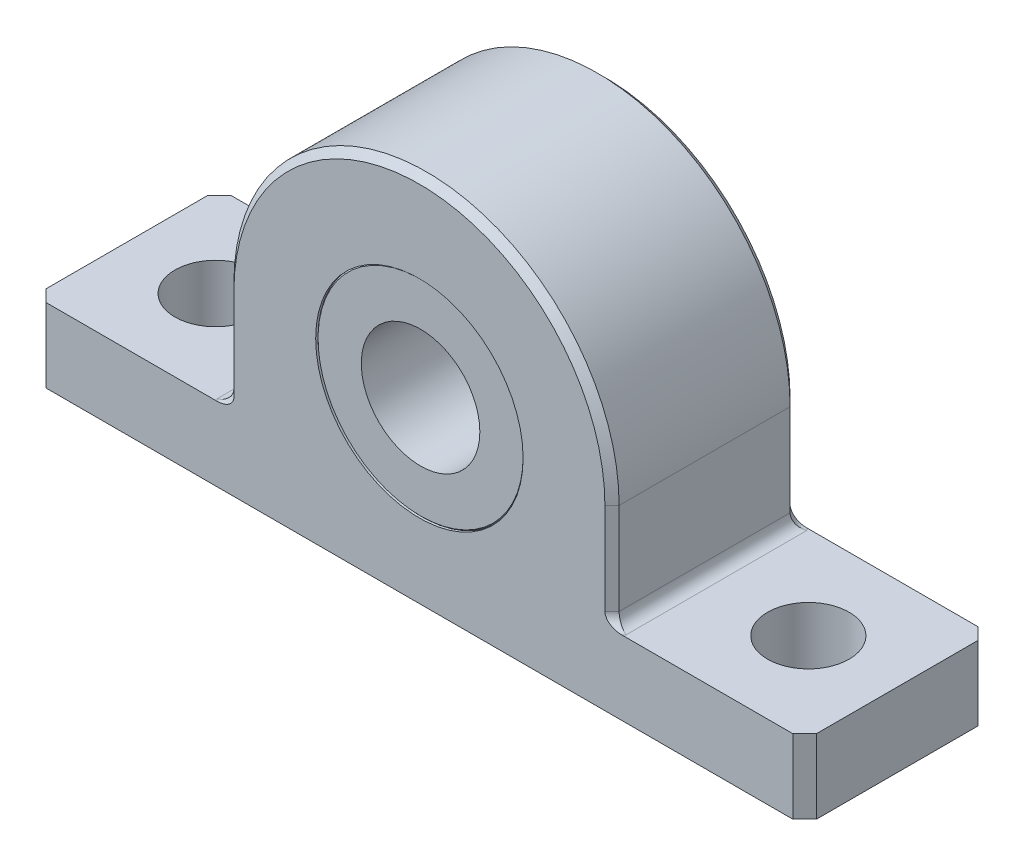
ISO-10303-21;
HEADER;
FILE_DESCRIPTION(('STEP AP214'),'2;1');
FILE_NAME('part.step','',(''),(''),'','','');
FILE_SCHEMA(('AUTOMOTIVE_DESIGN { 1 0 10303 214 1 1 1 1 }'));
ENDSEC;
DATA;
#1=APPLICATION_CONTEXT('core data for automotive mechanical design processes');
#2=APPLICATION_PROTOCOL_DEFINITION('international standard','automotive_design',2000,#1);
#3=PRODUCT_CONTEXT('',#1,'mechanical');
#4=PRODUCT('Part','Part','',(#3));
#5=PRODUCT_RELATED_PRODUCT_CATEGORY('part','',(#4));
#6=PRODUCT_DEFINITION_FORMATION('','',#4);
#7=PRODUCT_DEFINITION_CONTEXT('part definition',#1,'design');
#8=PRODUCT_DEFINITION('design','',#6,#7);
#9=PRODUCT_DEFINITION_SHAPE('','',#8);
#10=(LENGTH_UNIT() NAMED_UNIT(*) SI_UNIT(.MILLI.,.METRE.));
#11=(NAMED_UNIT(*) PLANE_ANGLE_UNIT() SI_UNIT($,.RADIAN.));
#12=(NAMED_UNIT(*) SI_UNIT($,.STERADIAN.) SOLID_ANGLE_UNIT());
#13=UNCERTAINTY_MEASURE_WITH_UNIT(LENGTH_MEASURE(1.E-05),#10,'distance_accuracy_value','');
#14=(GEOMETRIC_REPRESENTATION_CONTEXT(3) GLOBAL_UNCERTAINTY_ASSIGNED_CONTEXT((#13)) GLOBAL_UNIT_ASSIGNED_CONTEXT((#10,
#11,#12)) REPRESENTATION_CONTEXT('',''));
#15=CARTESIAN_POINT('',(0.,0.,0.));
#16=DIRECTION('',(0.,0.,1.));
#17=DIRECTION('',(1.,0.,0.));
#18=AXIS2_PLACEMENT_3D('',#15,#16,#17);
#19=CARTESIAN_POINT('',(0.,0.,-9.921875));
#20=DIRECTION('',(0.,0.,1.));
#21=DIRECTION('',(1.,0.,0.));
#22=AXIS2_PLACEMENT_3D('',#19,#20,#21);
#23=CYLINDRICAL_SURFACE('',#22,11.1125);
#24=CARTESIAN_POINT('',(0.,0.,9.92187500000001));
#25=DIRECTION('',(0.,0.,1.));
#26=DIRECTION('',(1.,0.,0.));
#27=AXIS2_PLACEMENT_3D('',#24,#25,#26);
#28=CIRCLE('',#27,11.1125);
#29=CARTESIAN_POINT('',(11.1125,0.,9.921875));
#30=VERTEX_POINT('',#29);
#31=EDGE_CURVE('E364',#30,#30,#28,.T.);
#32=CARTESIAN_POINT('',(0.,0.,9.667875));
#33=DIRECTION('',(0.,0.,-1.));
#34=DIRECTION('',(0.,1.,0.));
#35=AXIS2_PLACEMENT_3D('',#32,#33,#34);
#36=CIRCLE('',#35,11.1125);
#37=CARTESIAN_POINT('',(11.1125,0.,9.667875));
#38=VERTEX_POINT('',#37);
#39=EDGE_CURVE('E11',#38,#38,#36,.F.);
#40=CARTESIAN_POINT('',(11.1125,0.,9.921875));
#41=CARTESIAN_POINT('',(11.1125,0.,9.91922916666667));
#42=CARTESIAN_POINT('',(11.1125,0.,9.91658333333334));
#43=CARTESIAN_POINT('',(11.1125,0.,9.91129166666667));
#44=CARTESIAN_POINT('',(11.1125,0.,9.90864583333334));
#45=CARTESIAN_POINT('',(11.1125,0.,9.90335416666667));
#46=CARTESIAN_POINT('',(11.1125,0.,9.90070833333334));
#47=CARTESIAN_POINT('',(11.1125,0.,9.89541666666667));
#48=CARTESIAN_POINT('',(11.1125,0.,9.89277083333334));
#49=CARTESIAN_POINT('',(11.1125,0.,9.88747916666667));
#50=CARTESIAN_POINT('',(11.1125,0.,9.88483333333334));
#51=CARTESIAN_POINT('',(11.1125,0.,9.87954166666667));
#52=CARTESIAN_POINT('',(11.1125,0.,9.87689583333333));
#53=CARTESIAN_POINT('',(11.1125,0.,9.87160416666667));
#54=CARTESIAN_POINT('',(11.1125,0.,9.86895833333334));
#55=CARTESIAN_POINT('',(11.1125,0.,9.86366666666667));
#56=CARTESIAN_POINT('',(11.1125,0.,9.86102083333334));
#57=CARTESIAN_POINT('',(11.1125,0.,9.85572916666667));
#58=CARTESIAN_POINT('',(11.1125,0.,9.85308333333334));
#59=CARTESIAN_POINT('',(11.1125,0.,9.84779166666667));
#60=CARTESIAN_POINT('',(11.1125,0.,9.84514583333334));
#61=CARTESIAN_POINT('',(11.1125,0.,9.83985416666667));
#62=CARTESIAN_POINT('',(11.1125,0.,9.83720833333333));
#63=CARTESIAN_POINT('',(11.1125,0.,9.83191666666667));
#64=CARTESIAN_POINT('',(11.1125,0.,9.82927083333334));
#65=CARTESIAN_POINT('',(11.1125,0.,9.82397916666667));
#66=CARTESIAN_POINT('',(11.1125,0.,9.82133333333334));
#67=CARTESIAN_POINT('',(11.1125,0.,9.81604166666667));
#68=CARTESIAN_POINT('',(11.1125,0.,9.81339583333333));
#69=CARTESIAN_POINT('',(11.1125,0.,9.80810416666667));
#70=CARTESIAN_POINT('',(11.1125,0.,9.80545833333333));
#71=CARTESIAN_POINT('',(11.1125,0.,9.80016666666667));
#72=CARTESIAN_POINT('',(11.1125,0.,9.79752083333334));
#73=CARTESIAN_POINT('',(11.1125,0.,9.79222916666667));
#74=CARTESIAN_POINT('',(11.1125,0.,9.78958333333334));
#75=CARTESIAN_POINT('',(11.1125,0.,9.78429166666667));
#76=CARTESIAN_POINT('',(11.1125,0.,9.78164583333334));
#77=CARTESIAN_POINT('',(11.1125,0.,9.77635416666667));
#78=CARTESIAN_POINT('',(11.1125,0.,9.77370833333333));
#79=CARTESIAN_POINT('',(11.1125,0.,9.76841666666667));
#80=CARTESIAN_POINT('',(11.1125,0.,9.76577083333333));
#81=CARTESIAN_POINT('',(11.1125,0.,9.76047916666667));
#82=CARTESIAN_POINT('',(11.1125,0.,9.75783333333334));
#83=CARTESIAN_POINT('',(11.1125,0.,9.75254166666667));
#84=CARTESIAN_POINT('',(11.1125,0.,9.74989583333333));
#85=CARTESIAN_POINT('',(11.1125,0.,9.74460416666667));
#86=CARTESIAN_POINT('',(11.1125,0.,9.74195833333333));
#87=CARTESIAN_POINT('',(11.1125,0.,9.73666666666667));
#88=CARTESIAN_POINT('',(11.1125,0.,9.73402083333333));
#89=CARTESIAN_POINT('',(11.1125,0.,9.72872916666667));
#90=CARTESIAN_POINT('',(11.1125,0.,9.72608333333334));
#91=CARTESIAN_POINT('',(11.1125,0.,9.72079166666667));
#92=CARTESIAN_POINT('',(11.1125,0.,9.71814583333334));
#93=CARTESIAN_POINT('',(11.1125,0.,9.71285416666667));
#94=CARTESIAN_POINT('',(11.1125,0.,9.71020833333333));
#95=CARTESIAN_POINT('',(11.1125,0.,9.70491666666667));
#96=CARTESIAN_POINT('',(11.1125,0.,9.70227083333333));
#97=CARTESIAN_POINT('',(11.1125,0.,9.69697916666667));
#98=CARTESIAN_POINT('',(11.1125,0.,9.69433333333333));
#99=CARTESIAN_POINT('',(11.1125,0.,9.68904166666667));
#100=CARTESIAN_POINT('',(11.1125,0.,9.68639583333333));
#101=CARTESIAN_POINT('',(11.1125,0.,9.68110416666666));
#102=CARTESIAN_POINT('',(11.1125,0.,9.67845833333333));
#103=CARTESIAN_POINT('',(11.1125,0.,9.67316666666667));
#104=CARTESIAN_POINT('',(11.1125,0.,9.67052083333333));
#105=CARTESIAN_POINT('',(11.1125,0.,9.667875));
#106=B_SPLINE_CURVE_WITH_KNOTS('',3,(#40,#41,#42,#43,#44,#45,#46,#47,#48,#49,#50,#51,#52,#53,
#54,#55,#56,#57,#58,#59,#60,#61,#62,#63,#64,#65,#66,#67,#68,#69,#70,#71,#72,#73,#74,#75,#76,#77,
#78,#79,#80,#81,#82,#83,#84,#85,#86,#87,#88,#89,#90,#91,#92,#93,#94,#95,#96,#97,#98,#99,#100,
#101,#102,#103,#104,#105),.UNSPECIFIED.,.F.,.F.,(4,2,2,2,2,2,2,2,2,2,2,2,2,2,2,2,2,2,2,2,2,2,2,
2,2,2,2,2,2,2,2,2,4),(0.,0.00793749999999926,0.0158749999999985,0.0238125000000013,
0.0317500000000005,0.0396874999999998,0.0476250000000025,0.0555625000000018,0.0635000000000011,
0.0714375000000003,0.0793749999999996,0.0873125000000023,0.0952500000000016,0.103187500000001,
0.111125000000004,0.119062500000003,0.127000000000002,0.134937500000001,0.142875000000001,
0.150812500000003,0.158750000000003,0.166687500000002,0.174625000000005,0.182562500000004,
0.190500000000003,0.198437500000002,0.206375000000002,0.214312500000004,0.222250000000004,
0.230187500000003,0.238125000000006,0.246062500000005,0.254000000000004),.UNSPECIFIED.);
#107=EDGE_CURVE('BSEAM34',#30,#38,#106,.T.);
#108=ORIENTED_EDGE('',*,*,#31,.T.);
#109=ORIENTED_EDGE('',*,*,#39,.F.);
#110=ORIENTED_EDGE('',*,*,#107,.T.);
#111=ORIENTED_EDGE('',*,*,#107,.F.);
#112=EDGE_LOOP('',(#108,#110,#109,#111));
#113=FACE_BOUND('',#112,.T.);
#114=ADVANCED_FACE('F34',(#113),#23,.F.);
#115=CARTESIAN_POINT('',(0.,0.,-9.921875));
#116=DIRECTION('',(0.,0.,1.));
#117=DIRECTION('',(1.,0.,0.));
#118=AXIS2_PLACEMENT_3D('',#115,#116,#117);
#119=CIRCLE('',#118,11.1125);
#120=CARTESIAN_POINT('',(11.1125,0.,-9.921875));
#121=VERTEX_POINT('',#120);
#122=EDGE_CURVE('E367',#121,#121,#119,.T.);
#123=CARTESIAN_POINT('',(0.,0.,8.524875));
#124=DIRECTION('',(0.,0.,1.));
#125=DIRECTION('',(0.,-1.,0.));
#126=AXIS2_PLACEMENT_3D('',#123,#124,#125);
#127=CIRCLE('',#126,11.1125);
#128=CARTESIAN_POINT('',(11.1125,0.,8.524875));
#129=VERTEX_POINT('',#128);
#130=EDGE_CURVE('E43',#129,#129,#127,.F.);
#131=CARTESIAN_POINT('',(11.1125,0.,-9.921875));
#132=CARTESIAN_POINT('',(11.1125,0.,-9.72972135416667));
#133=CARTESIAN_POINT('',(11.1125,0.,-9.53756770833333));
#134=CARTESIAN_POINT('',(11.1125,0.,-9.15326041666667));
#135=CARTESIAN_POINT('',(11.1125,0.,-8.96110677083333));
#136=CARTESIAN_POINT('',(11.1125,0.,-8.57679947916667));
#137=CARTESIAN_POINT('',(11.1125,0.,-8.38464583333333));
#138=CARTESIAN_POINT('',(11.1125,0.,-8.00033854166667));
#139=CARTESIAN_POINT('',(11.1125,0.,-7.80818489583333));
#140=CARTESIAN_POINT('',(11.1125,0.,-7.42387760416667));
#141=CARTESIAN_POINT('',(11.1125,0.,-7.23172395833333));
#142=CARTESIAN_POINT('',(11.1125,0.,-6.84741666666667));
#143=CARTESIAN_POINT('',(11.1125,0.,-6.65526302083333));
#144=CARTESIAN_POINT('',(11.1125,0.,-6.27095572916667));
#145=CARTESIAN_POINT('',(11.1125,0.,-6.07880208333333));
#146=CARTESIAN_POINT('',(11.1125,0.,-5.69449479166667));
#147=CARTESIAN_POINT('',(11.1125,0.,-5.50234114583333));
#148=CARTESIAN_POINT('',(11.1125,0.,-5.11803385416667));
#149=CARTESIAN_POINT('',(11.1125,0.,-4.92588020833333));
#150=CARTESIAN_POINT('',(11.1125,0.,-4.54157291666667));
#151=CARTESIAN_POINT('',(11.1125,0.,-4.34941927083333));
#152=CARTESIAN_POINT('',(11.1125,0.,-3.96511197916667));
#153=CARTESIAN_POINT('',(11.1125,0.,-3.77295833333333));
#154=CARTESIAN_POINT('',(11.1125,0.,-3.38865104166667));
#155=CARTESIAN_POINT('',(11.1125,0.,-3.19649739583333));
#156=CARTESIAN_POINT('',(11.1125,0.,-2.81219010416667));
#157=CARTESIAN_POINT('',(11.1125,0.,-2.62003645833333));
#158=CARTESIAN_POINT('',(11.1125,0.,-2.23572916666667));
#159=CARTESIAN_POINT('',(11.1125,0.,-2.04357552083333));
#160=CARTESIAN_POINT('',(11.1125,0.,-1.65926822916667));
#161=CARTESIAN_POINT('',(11.1125,0.,-1.46711458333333));
#162=CARTESIAN_POINT('',(11.1125,0.,-1.08280729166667));
#163=CARTESIAN_POINT('',(11.1125,0.,-0.890653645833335));
#164=CARTESIAN_POINT('',(11.1125,0.,-0.506346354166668));
#165=CARTESIAN_POINT('',(11.1125,0.,-0.314192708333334));
#166=CARTESIAN_POINT('',(11.1125,0.,0.0701145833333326));
#167=CARTESIAN_POINT('',(11.1125,0.,0.262268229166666));
#168=CARTESIAN_POINT('',(11.1125,0.,0.646575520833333));
#169=CARTESIAN_POINT('',(11.1125,0.,0.838729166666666));
#170=CARTESIAN_POINT('',(11.1125,0.,1.22303645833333));
#171=CARTESIAN_POINT('',(11.1125,0.,1.41519010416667));
#172=CARTESIAN_POINT('',(11.1125,0.,1.79949739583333));
#173=CARTESIAN_POINT('',(11.1125,0.,1.99165104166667));
#174=CARTESIAN_POINT('',(11.1125,0.,2.37595833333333));
#175=CARTESIAN_POINT('',(11.1125,0.,2.56811197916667));
#176=CARTESIAN_POINT('',(11.1125,0.,2.95241927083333));
#177=CARTESIAN_POINT('',(11.1125,0.,3.14457291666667));
#178=CARTESIAN_POINT('',(11.1125,0.,3.52888020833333));
#179=CARTESIAN_POINT('',(11.1125,0.,3.72103385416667));
#180=CARTESIAN_POINT('',(11.1125,0.,4.10534114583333));
#181=CARTESIAN_POINT('',(11.1125,0.,4.29749479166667));
#182=CARTESIAN_POINT('',(11.1125,0.,4.68180208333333));
#183=CARTESIAN_POINT('',(11.1125,0.,4.87395572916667));
#184=CARTESIAN_POINT('',(11.1125,0.,5.25826302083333));
#185=CARTESIAN_POINT('',(11.1125,0.,5.45041666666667));
#186=CARTESIAN_POINT('',(11.1125,0.,5.83472395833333));
#187=CARTESIAN_POINT('',(11.1125,0.,6.02687760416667));
#188=CARTESIAN_POINT('',(11.1125,0.,6.41118489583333));
#189=CARTESIAN_POINT('',(11.1125,0.,6.60333854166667));
#190=CARTESIAN_POINT('',(11.1125,0.,6.98764583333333));
#191=CARTESIAN_POINT('',(11.1125,0.,7.17979947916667));
#192=CARTESIAN_POINT('',(11.1125,0.,7.56410677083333));
#193=CARTESIAN_POINT('',(11.1125,0.,7.75626041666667));
#194=CARTESIAN_POINT('',(11.1125,0.,8.14056770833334));
#195=CARTESIAN_POINT('',(11.1125,0.,8.33272135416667));
#196=CARTESIAN_POINT('',(11.1125,0.,8.524875));
#197=B_SPLINE_CURVE_WITH_KNOTS('',3,(#131,#132,#133,#134,#135,#136,#137,#138,#139,#140,#141,
#142,#143,#144,#145,#146,#147,#148,#149,#150,#151,#152,#153,#154,#155,#156,#157,#158,#159,#160,
#161,#162,#163,#164,#165,#166,#167,#168,#169,#170,#171,#172,#173,#174,#175,#176,#177,#178,#179,
#180,#181,#182,#183,#184,#185,#186,#187,#188,#189,#190,#191,#192,#193,#194,#195,#196),
.UNSPECIFIED.,.F.,.F.,(4,2,2,2,2,2,2,2,2,2,2,2,2,2,2,2,2,2,2,2,2,2,2,2,2,2,2,2,2,2,2,2,4),(0.,
0.5764609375,1.152921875,1.7293828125,2.30584375,2.8823046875,3.458765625,4.0352265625,
4.6116875,5.1881484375,5.764609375,6.3410703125,6.91753125,7.4939921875,8.070453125,
8.6469140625,9.223375,9.7998359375,10.376296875,10.9527578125,11.52921875,12.1056796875,
12.682140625,13.2586015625,13.8350625,14.4115234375,14.987984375,15.5644453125,16.14090625,
16.7173671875,17.293828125,17.8702890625,18.44675),.UNSPECIFIED.);
#198=EDGE_CURVE('BSEAM438',#121,#129,#197,.T.);
#199=ORIENTED_EDGE('',*,*,#122,.F.);
#200=ORIENTED_EDGE('',*,*,#130,.F.);
#201=ORIENTED_EDGE('',*,*,#198,.T.);
#202=ORIENTED_EDGE('',*,*,#198,.F.);
#203=EDGE_LOOP('',(#199,#201,#200,#202));
#204=FACE_BOUND('',#203,.T.);
#205=ADVANCED_FACE('F438',(#204),#23,.F.);
#206=CARTESIAN_POINT('',(0.,0.,9.921875));
#207=DIRECTION('',(0.,0.,-1.));
#208=DIRECTION('',(-1.,0.,0.));
#209=AXIS2_PLACEMENT_3D('',#206,#207,#208);
#210=CYLINDRICAL_SURFACE('',#209,20.6375);
#211=DIRECTION('',(0.,0.,-1.));
#212=VECTOR('',#211,1.);
#213=CARTESIAN_POINT('',(20.6375,0.,9.921875));
#214=LINE('',#213,#212);
#215=CARTESIAN_POINT('',(20.6375,0.,9.159875));
#216=VERTEX_POINT('',#215);
#217=CARTESIAN_POINT('',(20.6375,0.,-9.159875));
#218=VERTEX_POINT('',#217);
#219=EDGE_CURVE('E241',#216,#218,#214,.T.);
#220=ORIENTED_EDGE('',*,*,#219,.T.);
#221=CARTESIAN_POINT('',(0.,0.,-9.159875));
#222=DIRECTION('',(0.,0.,1.));
#223=DIRECTION('',(1.,0.,0.));
#224=AXIS2_PLACEMENT_3D('',#221,#222,#223);
#225=CIRCLE('',#224,20.6375);
#226=CARTESIAN_POINT('',(-20.6375,0.,-9.159875));
#227=VERTEX_POINT('',#226);
#228=EDGE_CURVE('E194',#218,#227,#225,.T.);
#229=ORIENTED_EDGE('',*,*,#228,.T.);
#230=DIRECTION('',(0.,0.,-1.));
#231=VECTOR('',#230,1.);
#232=CARTESIAN_POINT('',(-20.6375,0.,9.921875));
#233=LINE('',#232,#231);
#234=CARTESIAN_POINT('',(-20.6375,0.,9.159875));
#235=VERTEX_POINT('',#234);
#236=EDGE_CURVE('E179',#235,#227,#233,.T.);
#237=ORIENTED_EDGE('',*,*,#236,.F.);
#238=CARTESIAN_POINT('',(0.,0.,9.159875));
#239=DIRECTION('',(0.,0.,1.));
#240=DIRECTION('',(1.,0.,0.));
#241=AXIS2_PLACEMENT_3D('',#238,#239,#240);
#242=CIRCLE('',#241,20.6375);
#243=EDGE_CURVE('E191',#235,#216,#242,.F.);
#244=ORIENTED_EDGE('',*,*,#243,.T.);
#245=EDGE_LOOP('',(#220,#229,#237,#244));
#246=FACE_BOUND('',#245,.T.);
#247=ADVANCED_FACE('F36',(#246),#210,.T.);
#248=CARTESIAN_POINT('',(-20.6375,0.,9.921875));
#249=DIRECTION('',(1.,0.,0.));
#250=DIRECTION('',(0.,1.,0.));
#251=AXIS2_PLACEMENT_3D('',#248,#249,#250);
#252=PLANE('',#251);
#253=DIRECTION('',(0.,-1.,0.));
#254=VECTOR('',#253,1.);
#255=CARTESIAN_POINT('',(-20.6375,0.,-9.159875));
#256=LINE('',#255,#254);
#257=CARTESIAN_POINT('',(-20.6375,-9.8425,-9.159875));
#258=VERTEX_POINT('',#257);
#259=EDGE_CURVE('E186',#227,#258,#256,.T.);
#260=ORIENTED_EDGE('',*,*,#259,.T.);
#261=DIRECTION('',(0.,0.,-1.));
#262=VECTOR('',#261,1.);
#263=CARTESIAN_POINT('',(-20.6375,-9.8425,9.159875));
#264=LINE('',#263,#262);
#265=CARTESIAN_POINT('',(-20.6375,-9.8425,9.159875));
#266=VERTEX_POINT('',#265);
#267=EDGE_CURVE('E182',#258,#266,#264,.F.);
#268=ORIENTED_EDGE('',*,*,#267,.T.);
#269=DIRECTION('',(0.,1.,0.));
#270=VECTOR('',#269,1.);
#271=CARTESIAN_POINT('',(-20.6375,0.,9.159875));
#272=LINE('',#271,#270);
#273=EDGE_CURVE('E175',#266,#235,#272,.T.);
#274=ORIENTED_EDGE('',*,*,#273,.T.);
#275=ORIENTED_EDGE('',*,*,#236,.T.);
#276=EDGE_LOOP('',(#260,#268,#274,#275));
#277=FACE_BOUND('',#276,.T.);
#278=ADVANCED_FACE('F178',(#277),#252,.F.);
#279=CARTESIAN_POINT('',(-20.6375,-11.1125,9.921875));
#280=DIRECTION('',(0.,-1.,0.));
#281=DIRECTION('',(1.,0.,0.));
#282=AXIS2_PLACEMENT_3D('',#279,#280,#281);
#283=PLANE('',#282);
#284=CARTESIAN_POINT('',(-31.75,-11.1125,0.));
#285=DIRECTION('',(0.,-1.,0.));
#286=DIRECTION('',(1.,0.,0.));
#287=AXIS2_PLACEMENT_3D('',#284,#285,#286);
#288=CIRCLE('',#287,4.365625);
#289=CARTESIAN_POINT('',(-31.75,-11.1125,4.365625));
#290=VERTEX_POINT('',#289);
#291=EDGE_CURVE('E350',#290,#290,#288,.T.);
#292=ORIENTED_EDGE('',*,*,#291,.T.);
#293=EDGE_LOOP('',(#292));
#294=FACE_BOUND('',#293,.T.);
#295=DIRECTION('',(-1.,0.,0.));
#296=VECTOR('',#295,1.);
#297=CARTESIAN_POINT('',(-20.6375,-11.1125,-9.921875));
#298=LINE('',#297,#296);
#299=CARTESIAN_POINT('',(-21.6715512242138,-11.1125,-9.921875));
#300=VERTEX_POINT('',#299);
#301=CARTESIAN_POINT('',(-40.005,-11.1125,-9.921875));
#302=VERTEX_POINT('',#301);
#303=EDGE_CURVE('E225',#300,#302,#298,.T.);
#304=ORIENTED_EDGE('',*,*,#303,.T.);
#305=DIRECTION('',(0.707106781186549,0.,-0.707106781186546));
#306=VECTOR('',#305,1.);
#307=CARTESIAN_POINT('',(-41.275,-11.1125,-8.651875));
#308=LINE('',#307,#306);
#309=CARTESIAN_POINT('',(-41.275,-11.1125,-8.651875));
#310=VERTEX_POINT('',#309);
#311=EDGE_CURVE('E325',#302,#310,#308,.F.);
#312=ORIENTED_EDGE('',*,*,#311,.T.);
#313=DIRECTION('',(0.,0.,-1.));
#314=VECTOR('',#313,1.);
#315=CARTESIAN_POINT('',(-41.275,-11.1125,9.921875));
#316=LINE('',#315,#314);
#317=CARTESIAN_POINT('',(-41.275,-11.1125,8.651875));
#318=VERTEX_POINT('',#317);
#319=EDGE_CURVE('E195',#318,#310,#316,.T.);
#320=ORIENTED_EDGE('',*,*,#319,.F.);
#321=DIRECTION('',(0.707106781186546,0.,0.707106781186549));
#322=VECTOR('',#321,1.);
#323=CARTESIAN_POINT('',(-40.005,-11.1125,9.921875));
#324=LINE('',#323,#322);
#325=CARTESIAN_POINT('',(-40.005,-11.1125,9.921875));
#326=VERTEX_POINT('',#325);
#327=EDGE_CURVE('E323',#318,#326,#324,.T.);
#328=ORIENTED_EDGE('',*,*,#327,.T.);
#329=DIRECTION('',(-1.,0.,0.));
#330=VECTOR('',#329,1.);
#331=CARTESIAN_POINT('',(-20.6375,-11.1125,9.921875));
#332=LINE('',#331,#330);
#333=CARTESIAN_POINT('',(-21.6715512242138,-11.1125,9.921875));
#334=VERTEX_POINT('',#333);
#335=EDGE_CURVE('E233',#334,#326,#332,.T.);
#336=ORIENTED_EDGE('',*,*,#335,.F.);
#337=DIRECTION('',(-0.707106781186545,0.,-0.70710678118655));
#338=VECTOR('',#337,1.);
#339=CARTESIAN_POINT('',(-21.1545256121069,-11.1125,10.4389006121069));
#340=LINE('',#339,#338);
#341=CARTESIAN_POINT('',(-21.9075,-11.1125,9.68592622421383));
#342=VERTEX_POINT('',#341);
#343=EDGE_CURVE('E273',#334,#342,#340,.T.);
#344=ORIENTED_EDGE('',*,*,#343,.T.);
#345=DIRECTION('',(0.,0.,-1.));
#346=VECTOR('',#345,1.);
#347=CARTESIAN_POINT('',(-21.9075,-11.1125,-9.159875));
#348=LINE('',#347,#346);
#349=CARTESIAN_POINT('',(-21.9075,-11.1125,-9.68592622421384));
#350=VERTEX_POINT('',#349);
#351=EDGE_CURVE('E271',#342,#350,#348,.T.);
#352=ORIENTED_EDGE('',*,*,#351,.T.);
#353=DIRECTION('',(-0.707106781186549,0.,0.707106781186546));
#354=VECTOR('',#353,1.);
#355=CARTESIAN_POINT('',(-31.0764006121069,-11.1125,-0.517025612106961));
#356=LINE('',#355,#354);
#357=EDGE_CURVE('E275',#350,#300,#356,.F.);
#358=ORIENTED_EDGE('',*,*,#357,.T.);
#359=EDGE_LOOP('',(#304,#312,#320,#328,#336,#344,#352,#358));
#360=FACE_BOUND('',#359,.T.);
#361=ADVANCED_FACE('F718',(#294,#360),#283,.F.);
#362=CARTESIAN_POINT('',(-41.275,-11.1125,9.921875));
#363=DIRECTION('',(1.,0.,0.));
#364=DIRECTION('',(0.,0.,-1.));
#365=AXIS2_PLACEMENT_3D('',#362,#363,#364);
#366=PLANE('',#365);
#367=ORIENTED_EDGE('',*,*,#319,.T.);
#368=DIRECTION('',(0.,-1.,0.));
#369=VECTOR('',#368,1.);
#370=CARTESIAN_POINT('',(-41.275,-11.1125,-8.651875));
#371=LINE('',#370,#369);
#372=CARTESIAN_POINT('',(-41.275,-19.05,-8.651875));
#373=VERTEX_POINT('',#372);
#374=EDGE_CURVE('E308',#310,#373,#371,.T.);
#375=ORIENTED_EDGE('',*,*,#374,.T.);
#376=DIRECTION('',(0.,0.,-1.));
#377=VECTOR('',#376,1.);
#378=CARTESIAN_POINT('',(-41.275,-19.05,9.921875));
#379=LINE('',#378,#377);
#380=CARTESIAN_POINT('',(-41.275,-19.05,8.65187499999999));
#381=VERTEX_POINT('',#380);
#382=EDGE_CURVE('E248',#381,#373,#379,.T.);
#383=ORIENTED_EDGE('',*,*,#382,.F.);
#384=DIRECTION('',(0.,1.,0.));
#385=VECTOR('',#384,1.);
#386=CARTESIAN_POINT('',(-41.275,-11.1125,8.65187499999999));
#387=LINE('',#386,#385);
#388=EDGE_CURVE('E306',#381,#318,#387,.T.);
#389=ORIENTED_EDGE('',*,*,#388,.T.);
#390=EDGE_LOOP('',(#367,#375,#383,#389));
#391=FACE_BOUND('',#390,.T.);
#392=ADVANCED_FACE('F710',(#391),#366,.F.);
#393=CARTESIAN_POINT('',(-41.275,-19.05,9.921875));
#394=DIRECTION('',(0.,1.,0.));
#395=DIRECTION('',(-1.,0.,0.));
#396=AXIS2_PLACEMENT_3D('',#393,#394,#395);
#397=PLANE('',#396);
#398=CARTESIAN_POINT('',(31.75,-19.05,0.));
#399=DIRECTION('',(0.,1.,0.));
#400=DIRECTION('',(0.,0.,1.));
#401=AXIS2_PLACEMENT_3D('',#398,#399,#400);
#402=CIRCLE('',#401,4.365625);
#403=CARTESIAN_POINT('',(31.75,-19.05,4.36562499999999));
#404=VERTEX_POINT('',#403);
#405=EDGE_CURVE('E773',#404,#404,#402,.T.);
#406=ORIENTED_EDGE('',*,*,#405,.T.);
#407=EDGE_LOOP('',(#406));
#408=FACE_BOUND('',#407,.T.);
#409=CARTESIAN_POINT('',(-31.75,-19.05,0.));
#410=DIRECTION('',(0.,1.,0.));
#411=DIRECTION('',(0.,0.,1.));
#412=AXIS2_PLACEMENT_3D('',#409,#410,#411);
#413=CIRCLE('',#412,4.365625);
#414=CARTESIAN_POINT('',(-31.75,-19.05,4.365625));
#415=VERTEX_POINT('',#414);
#416=EDGE_CURVE('E355',#415,#415,#413,.T.);
#417=ORIENTED_EDGE('',*,*,#416,.T.);
#418=EDGE_LOOP('',(#417));
#419=FACE_BOUND('',#418,.T.);
#420=ORIENTED_EDGE('',*,*,#382,.T.);
#421=DIRECTION('',(-0.707106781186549,0.,0.707106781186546));
#422=VECTOR('',#421,1.);
#423=CARTESIAN_POINT('',(-41.275,-19.05,-8.651875));
#424=LINE('',#423,#422);
#425=CARTESIAN_POINT('',(-40.005,-19.05,-9.921875));
#426=VERTEX_POINT('',#425);
#427=EDGE_CURVE('E317',#373,#426,#424,.F.);
#428=ORIENTED_EDGE('',*,*,#427,.T.);
#429=DIRECTION('',(1.,0.,0.));
#430=VECTOR('',#429,1.);
#431=CARTESIAN_POINT('',(-41.275,-19.05,-9.921875));
#432=LINE('',#431,#430);
#433=CARTESIAN_POINT('',(40.005,-19.05,-9.921875));
#434=VERTEX_POINT('',#433);
#435=EDGE_CURVE('E228',#426,#434,#432,.T.);
#436=ORIENTED_EDGE('',*,*,#435,.T.);
#437=DIRECTION('',(-0.707106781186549,0.,-0.707106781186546));
#438=VECTOR('',#437,1.);
#439=CARTESIAN_POINT('',(41.275,-19.05,-8.651875));
#440=LINE('',#439,#438);
#441=CARTESIAN_POINT('',(41.275,-19.05,-8.651875));
#442=VERTEX_POINT('',#441);
#443=EDGE_CURVE('E313',#434,#442,#440,.F.);
#444=ORIENTED_EDGE('',*,*,#443,.T.);
#445=DIRECTION('',(0.,0.,-1.));
#446=VECTOR('',#445,1.);
#447=CARTESIAN_POINT('',(41.275,-19.05,9.921875));
#448=LINE('',#447,#446);
#449=CARTESIAN_POINT('',(41.275,-19.05,8.65187499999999));
#450=VERTEX_POINT('',#449);
#451=EDGE_CURVE('E245',#450,#442,#448,.T.);
#452=ORIENTED_EDGE('',*,*,#451,.F.);
#453=DIRECTION('',(-0.707106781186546,0.,0.707106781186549));
#454=VECTOR('',#453,1.);
#455=CARTESIAN_POINT('',(40.005,-19.05,9.921875));
#456=LINE('',#455,#454);
#457=CARTESIAN_POINT('',(40.005,-19.05,9.92187500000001));
#458=VERTEX_POINT('',#457);
#459=EDGE_CURVE('E311',#450,#458,#456,.T.);
#460=ORIENTED_EDGE('',*,*,#459,.T.);
#461=DIRECTION('',(1.,0.,0.));
#462=VECTOR('',#461,1.);
#463=CARTESIAN_POINT('',(-41.275,-19.05,9.921875));
#464=LINE('',#463,#462);
#465=CARTESIAN_POINT('',(-40.005,-19.05,9.921875));
#466=VERTEX_POINT('',#465);
#467=EDGE_CURVE('E236',#466,#458,#464,.T.);
#468=ORIENTED_EDGE('',*,*,#467,.F.);
#469=DIRECTION('',(-0.707106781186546,0.,-0.707106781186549));
#470=VECTOR('',#469,1.);
#471=CARTESIAN_POINT('',(-40.005,-19.05,9.921875));
#472=LINE('',#471,#470);
#473=EDGE_CURVE('E315',#466,#381,#472,.T.);
#474=ORIENTED_EDGE('',*,*,#473,.T.);
#475=EDGE_LOOP('',(#420,#428,#436,#444,#452,#460,#468,#474));
#476=FACE_BOUND('',#475,.T.);
#477=ADVANCED_FACE('F702',(#408,#419,#476),#397,.F.);
#478=CARTESIAN_POINT('',(41.275,-19.05,9.921875));
#479=DIRECTION('',(-1.,0.,0.));
#480=DIRECTION('',(0.,0.,1.));
#481=AXIS2_PLACEMENT_3D('',#478,#479,#480);
#482=PLANE('',#481);
#483=ORIENTED_EDGE('',*,*,#451,.T.);
#484=DIRECTION('',(0.,1.,0.));
#485=VECTOR('',#484,1.);
#486=CARTESIAN_POINT('',(41.275,-19.05,-8.651875));
#487=LINE('',#486,#485);
#488=CARTESIAN_POINT('',(41.275,-11.1125,-8.651875));
#489=VERTEX_POINT('',#488);
#490=EDGE_CURVE('E335',#442,#489,#487,.T.);
#491=ORIENTED_EDGE('',*,*,#490,.T.);
#492=DIRECTION('',(0.,0.,-1.));
#493=VECTOR('',#492,1.);
#494=CARTESIAN_POINT('',(41.275,-11.1125,9.921875));
#495=LINE('',#494,#493);
#496=CARTESIAN_POINT('',(41.275,-11.1125,8.65187499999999));
#497=VERTEX_POINT('',#496);
#498=EDGE_CURVE('E243',#497,#489,#495,.T.);
#499=ORIENTED_EDGE('',*,*,#498,.F.);
#500=DIRECTION('',(0.,-1.,0.));
#501=VECTOR('',#500,1.);
#502=CARTESIAN_POINT('',(41.275,-19.05,8.65187499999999));
#503=LINE('',#502,#501);
#504=EDGE_CURVE('E333',#497,#450,#503,.T.);
#505=ORIENTED_EDGE('',*,*,#504,.T.);
#506=EDGE_LOOP('',(#483,#491,#499,#505));
#507=FACE_BOUND('',#506,.T.);
#508=ADVANCED_FACE('F693',(#507),#482,.F.);
#509=CARTESIAN_POINT('',(41.275,-11.1125,9.921875));
#510=DIRECTION('',(0.,-1.,0.));
#511=DIRECTION('',(1.,0.,0.));
#512=AXIS2_PLACEMENT_3D('',#509,#510,#511);
#513=PLANE('',#512);
#514=CARTESIAN_POINT('',(31.75,-11.1125,0.));
#515=DIRECTION('',(0.,-1.,0.));
#516=DIRECTION('',(1.,0.,0.));
#517=AXIS2_PLACEMENT_3D('',#514,#515,#516);
#518=CIRCLE('',#517,4.365625);
#519=CARTESIAN_POINT('',(31.75,-11.1125,4.36562499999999));
#520=VERTEX_POINT('',#519);
#521=EDGE_CURVE('E38',#520,#520,#518,.T.);
#522=ORIENTED_EDGE('',*,*,#521,.T.);
#523=EDGE_LOOP('',(#522));
#524=FACE_BOUND('',#523,.T.);
#525=ORIENTED_EDGE('',*,*,#498,.T.);
#526=DIRECTION('',(0.707106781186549,0.,0.707106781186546));
#527=VECTOR('',#526,1.);
#528=CARTESIAN_POINT('',(41.275,-11.1125,-8.651875));
#529=LINE('',#528,#527);
#530=CARTESIAN_POINT('',(40.005,-11.1125,-9.921875));
#531=VERTEX_POINT('',#530);
#532=EDGE_CURVE('E51',#489,#531,#529,.F.);
#533=ORIENTED_EDGE('',*,*,#532,.T.);
#534=DIRECTION('',(-1.,0.,0.));
#535=VECTOR('',#534,1.);
#536=CARTESIAN_POINT('',(41.275,-11.1125,-9.921875));
#537=LINE('',#536,#535);
#538=CARTESIAN_POINT('',(21.6715512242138,-11.1125,-9.921875));
#539=VERTEX_POINT('',#538);
#540=EDGE_CURVE('E231',#531,#539,#537,.T.);
#541=ORIENTED_EDGE('',*,*,#540,.T.);
#542=DIRECTION('',(-0.707106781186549,0.,-0.707106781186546));
#543=VECTOR('',#542,1.);
#544=CARTESIAN_POINT('',(41.395150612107,-11.1125,9.80172438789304));
#545=LINE('',#544,#543);
#546=CARTESIAN_POINT('',(21.9075,-11.1125,-9.68592622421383));
#547=VERTEX_POINT('',#546);
#548=EDGE_CURVE('E288',#539,#547,#545,.F.);
#549=ORIENTED_EDGE('',*,*,#548,.T.);
#550=DIRECTION('',(0.,0.,-1.));
#551=VECTOR('',#550,1.);
#552=CARTESIAN_POINT('',(21.9075,-11.1125,9.159875));
#553=LINE('',#552,#551);
#554=CARTESIAN_POINT('',(21.9075,-11.1125,9.68592622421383));
#555=VERTEX_POINT('',#554);
#556=EDGE_CURVE('E283',#547,#555,#553,.F.);
#557=ORIENTED_EDGE('',*,*,#556,.T.);
#558=DIRECTION('',(-0.707106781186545,0.,0.70710678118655));
#559=VECTOR('',#558,1.);
#560=CARTESIAN_POINT('',(31.4732756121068,-11.1125,0.120150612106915));
#561=LINE('',#560,#559);
#562=CARTESIAN_POINT('',(21.6715512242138,-11.1125,9.921875));
#563=VERTEX_POINT('',#562);
#564=EDGE_CURVE('E285',#555,#563,#561,.T.);
#565=ORIENTED_EDGE('',*,*,#564,.T.);
#566=DIRECTION('',(-1.,0.,0.));
#567=VECTOR('',#566,1.);
#568=CARTESIAN_POINT('',(41.275,-11.1125,9.921875));
#569=LINE('',#568,#567);
#570=CARTESIAN_POINT('',(40.005,-11.1125,9.921875));
#571=VERTEX_POINT('',#570);
#572=EDGE_CURVE('E239',#571,#563,#569,.T.);
#573=ORIENTED_EDGE('',*,*,#572,.F.);
#574=DIRECTION('',(0.707106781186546,0.,-0.707106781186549));
#575=VECTOR('',#574,1.);
#576=CARTESIAN_POINT('',(40.005,-11.1125,9.921875));
#577=LINE('',#576,#575);
#578=EDGE_CURVE('E59',#571,#497,#577,.T.);
#579=ORIENTED_EDGE('',*,*,#578,.T.);
#580=EDGE_LOOP('',(#525,#533,#541,#549,#557,#565,#573,#579));
#581=FACE_BOUND('',#580,.T.);
#582=ADVANCED_FACE('F686',(#524,#581),#513,.F.);
#583=CARTESIAN_POINT('',(20.6375,-11.1125,9.921875));
#584=DIRECTION('',(-1.,0.,0.));
#585=DIRECTION('',(0.,-1.,0.));
#586=AXIS2_PLACEMENT_3D('',#583,#584,#585);
#587=PLANE('',#586);
#588=DIRECTION('',(0.,-1.,0.));
#589=VECTOR('',#588,1.);
#590=CARTESIAN_POINT('',(20.6375,-11.1125,9.159875));
#591=LINE('',#590,#589);
#592=CARTESIAN_POINT('',(20.6375,-9.84249999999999,9.159875));
#593=VERTEX_POINT('',#592);
#594=EDGE_CURVE('E261',#216,#593,#591,.T.);
#595=ORIENTED_EDGE('',*,*,#594,.T.);
#596=DIRECTION('',(0.,0.,-1.));
#597=VECTOR('',#596,1.);
#598=CARTESIAN_POINT('',(20.6375,-9.84249999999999,-9.159875));
#599=LINE('',#598,#597);
#600=CARTESIAN_POINT('',(20.6375,-9.84249999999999,-9.159875));
#601=VERTEX_POINT('',#600);
#602=EDGE_CURVE('E295',#593,#601,#599,.T.);
#603=ORIENTED_EDGE('',*,*,#602,.T.);
#604=DIRECTION('',(0.,1.,0.));
#605=VECTOR('',#604,1.);
#606=CARTESIAN_POINT('',(20.6375,-11.1125,-9.159875));
#607=LINE('',#606,#605);
#608=EDGE_CURVE('E264',#601,#218,#607,.T.);
#609=ORIENTED_EDGE('',*,*,#608,.T.);
#610=ORIENTED_EDGE('',*,*,#219,.F.);
#611=EDGE_LOOP('',(#595,#603,#609,#610));
#612=FACE_BOUND('',#611,.T.);
#613=ADVANCED_FACE('F399',(#612),#587,.F.);
#614=CARTESIAN_POINT('',(0.,0.,9.921875));
#615=DIRECTION('',(0.,0.,1.));
#616=DIRECTION('',(1.,0.,0.));
#617=AXIS2_PLACEMENT_3D('',#614,#615,#616);
#618=PLANE('',#617);
#619=ORIENTED_EDGE('',*,*,#31,.F.);
#620=EDGE_LOOP('',(#619));
#621=FACE_BOUND('',#620,.T.);
#622=ORIENTED_EDGE('',*,*,#335,.T.);
#623=DIRECTION('',(0.,-1.,0.));
#624=VECTOR('',#623,1.);
#625=CARTESIAN_POINT('',(-40.005,-19.05,9.921875));
#626=LINE('',#625,#624);
#627=EDGE_CURVE('E330',#326,#466,#626,.T.);
#628=ORIENTED_EDGE('',*,*,#627,.T.);
#629=ORIENTED_EDGE('',*,*,#467,.T.);
#630=DIRECTION('',(0.,1.,0.));
#631=VECTOR('',#630,1.);
#632=CARTESIAN_POINT('',(40.005,-11.1125,9.921875));
#633=LINE('',#632,#631);
#634=EDGE_CURVE('E327',#458,#571,#633,.T.);
#635=ORIENTED_EDGE('',*,*,#634,.T.);
#636=ORIENTED_EDGE('',*,*,#572,.T.);
#637=CARTESIAN_POINT('',(21.6715512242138,-9.84249999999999,9.921875));
#638=DIRECTION('',(0.,0.,1.));
#639=DIRECTION('',(-1.,0.,0.));
#640=AXIS2_PLACEMENT_3D('',#637,#638,#639);
#641=ELLIPSE('',#640,1.79605122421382,1.27);
#642=CARTESIAN_POINT('',(19.8755,-9.84249999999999,9.921875));
#643=VERTEX_POINT('',#642);
#644=EDGE_CURVE('E304',#563,#643,#641,.F.);
#645=ORIENTED_EDGE('',*,*,#644,.T.);
#646=DIRECTION('',(0.,1.,0.));
#647=VECTOR('',#646,1.);
#648=CARTESIAN_POINT('',(19.8755,0.,9.921875));
#649=LINE('',#648,#647);
#650=CARTESIAN_POINT('',(19.8755,0.,9.921875));
#651=VERTEX_POINT('',#650);
#652=EDGE_CURVE('E268',#643,#651,#649,.T.);
#653=ORIENTED_EDGE('',*,*,#652,.T.);
#654=CARTESIAN_POINT('',(0.,0.,9.921875));
#655=DIRECTION('',(0.,0.,1.));
#656=DIRECTION('',(1.,0.,0.));
#657=AXIS2_PLACEMENT_3D('',#654,#655,#656);
#658=CIRCLE('',#657,19.8755);
#659=CARTESIAN_POINT('',(-19.8755,0.,9.921875));
#660=VERTEX_POINT('',#659);
#661=EDGE_CURVE('E266',#651,#660,#658,.T.);
#662=ORIENTED_EDGE('',*,*,#661,.T.);
#663=DIRECTION('',(0.,-1.,0.));
#664=VECTOR('',#663,1.);
#665=CARTESIAN_POINT('',(-19.8755,-11.1125,9.921875));
#666=LINE('',#665,#664);
#667=CARTESIAN_POINT('',(-19.8755,-9.8425,9.921875));
#668=VERTEX_POINT('',#667);
#669=EDGE_CURVE('E210',#660,#668,#666,.T.);
#670=ORIENTED_EDGE('',*,*,#669,.T.);
#671=CARTESIAN_POINT('',(-21.6715512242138,-9.8425,9.921875));
#672=DIRECTION('',(0.,0.,1.));
#673=DIRECTION('',(-1.,0.,0.));
#674=AXIS2_PLACEMENT_3D('',#671,#672,#673);
#675=ELLIPSE('',#674,1.79605122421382,1.27);
#676=EDGE_CURVE('E299',#668,#334,#675,.F.);
#677=ORIENTED_EDGE('',*,*,#676,.T.);
#678=EDGE_LOOP('',(#622,#628,#629,#635,#636,#645,#653,#662,#670,#677));
#679=FACE_BOUND('',#678,.T.);
#680=ADVANCED_FACE('F389',(#621,#679),#618,.T.);
#681=CARTESIAN_POINT('',(0.,0.,-9.921875));
#682=DIRECTION('',(0.,0.,1.));
#683=DIRECTION('',(1.,0.,0.));
#684=AXIS2_PLACEMENT_3D('',#681,#682,#683);
#685=PLANE('',#684);
#686=ORIENTED_EDGE('',*,*,#122,.T.);
#687=EDGE_LOOP('',(#686));
#688=FACE_BOUND('',#687,.T.);
#689=ORIENTED_EDGE('',*,*,#435,.F.);
#690=DIRECTION('',(0.,1.,0.));
#691=VECTOR('',#690,1.);
#692=CARTESIAN_POINT('',(-40.005,0.,-9.921875));
#693=LINE('',#692,#691);
#694=EDGE_CURVE('E321',#426,#302,#693,.T.);
#695=ORIENTED_EDGE('',*,*,#694,.T.);
#696=ORIENTED_EDGE('',*,*,#303,.F.);
#697=CARTESIAN_POINT('',(-21.6715512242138,-9.8425,-9.921875));
#698=DIRECTION('',(0.,0.,1.));
#699=DIRECTION('',(-1.,0.,0.));
#700=AXIS2_PLACEMENT_3D('',#697,#698,#699);
#701=ELLIPSE('',#700,1.79605122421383,1.27);
#702=CARTESIAN_POINT('',(-19.8755,-9.8425,-9.921875));
#703=VERTEX_POINT('',#702);
#704=EDGE_CURVE('E297',#300,#703,#701,.T.);
#705=ORIENTED_EDGE('',*,*,#704,.T.);
#706=DIRECTION('',(0.,1.,0.));
#707=VECTOR('',#706,1.);
#708=CARTESIAN_POINT('',(-19.8755,0.,-9.921875));
#709=LINE('',#708,#707);
#710=CARTESIAN_POINT('',(-19.8755,0.,-9.921875));
#711=VERTEX_POINT('',#710);
#712=EDGE_CURVE('E206',#703,#711,#709,.T.);
#713=ORIENTED_EDGE('',*,*,#712,.T.);
#714=CARTESIAN_POINT('',(0.,0.,-9.921875));
#715=DIRECTION('',(0.,0.,1.));
#716=DIRECTION('',(1.,0.,0.));
#717=AXIS2_PLACEMENT_3D('',#714,#715,#716);
#718=CIRCLE('',#717,19.8755);
#719=CARTESIAN_POINT('',(19.8755,0.,-9.921875));
#720=VERTEX_POINT('',#719);
#721=EDGE_CURVE('E257',#711,#720,#718,.F.);
#722=ORIENTED_EDGE('',*,*,#721,.T.);
#723=DIRECTION('',(0.,-1.,0.));
#724=VECTOR('',#723,1.);
#725=CARTESIAN_POINT('',(19.8755,0.,-9.921875));
#726=LINE('',#725,#724);
#727=CARTESIAN_POINT('',(19.8755,-9.84249999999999,-9.921875));
#728=VERTEX_POINT('',#727);
#729=EDGE_CURVE('E254',#720,#728,#726,.T.);
#730=ORIENTED_EDGE('',*,*,#729,.T.);
#731=CARTESIAN_POINT('',(21.6715512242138,-9.84249999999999,-9.921875));
#732=DIRECTION('',(0.,0.,1.));
#733=DIRECTION('',(-1.,0.,0.));
#734=AXIS2_PLACEMENT_3D('',#731,#732,#733);
#735=ELLIPSE('',#734,1.79605122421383,1.27);
#736=EDGE_CURVE('E301',#728,#539,#735,.T.);
#737=ORIENTED_EDGE('',*,*,#736,.T.);
#738=ORIENTED_EDGE('',*,*,#540,.F.);
#739=DIRECTION('',(0.,-1.,0.));
#740=VECTOR('',#739,1.);
#741=CARTESIAN_POINT('',(40.005,0.,-9.921875));
#742=LINE('',#741,#740);
#743=EDGE_CURVE('E319',#531,#434,#742,.T.);
#744=ORIENTED_EDGE('',*,*,#743,.T.);
#745=EDGE_LOOP('',(#689,#695,#696,#705,#713,#722,#730,#737,#738,#744));
#746=FACE_BOUND('',#745,.T.);
#747=ADVANCED_FACE('F420',(#688,#746),#685,.F.);
#748=CARTESIAN_POINT('',(20.6375,-11.1125,-9.159875));
#749=DIRECTION('',(-0.707106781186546,0.,0.707106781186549));
#750=DIRECTION('',(0.707106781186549,0.,0.707106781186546));
#751=AXIS2_PLACEMENT_3D('',#748,#749,#750);
#752=PLANE('',#751);
#753=ORIENTED_EDGE('',*,*,#608,.F.);
#754=DIRECTION('',(0.707106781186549,0.,0.707106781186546));
#755=VECTOR('',#754,1.);
#756=CARTESIAN_POINT('',(20.6375,-9.84249999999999,-9.159875));
#757=LINE('',#756,#755);
#758=EDGE_CURVE('E291',#601,#728,#757,.F.);
#759=ORIENTED_EDGE('',*,*,#758,.T.);
#760=ORIENTED_EDGE('',*,*,#729,.F.);
#761=DIRECTION('',(-0.707106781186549,0.,-0.707106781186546));
#762=VECTOR('',#761,1.);
#763=CARTESIAN_POINT('',(20.6375,0.,-9.159875));
#764=LINE('',#763,#762);
#765=EDGE_CURVE('E222',#218,#720,#764,.T.);
#766=ORIENTED_EDGE('',*,*,#765,.F.);
#767=EDGE_LOOP('',(#753,#759,#760,#766));
#768=FACE_BOUND('',#767,.T.);
#769=ADVANCED_FACE('F416',(#768),#752,.F.);
#770=CARTESIAN_POINT('',(0.,0.,-9.159875));
#771=DIRECTION('',(0.,0.,1.));
#772=DIRECTION('',(1.,0.,0.));
#773=AXIS2_PLACEMENT_3D('',#770,#771,#772);
#774=CONICAL_SURFACE('',#773,20.6375,0.785398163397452);
#775=ORIENTED_EDGE('',*,*,#765,.T.);
#776=ORIENTED_EDGE('',*,*,#721,.F.);
#777=DIRECTION('',(0.70710678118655,0.,-0.707106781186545));
#778=VECTOR('',#777,1.);
#779=CARTESIAN_POINT('',(-20.6375,0.,-9.159875));
#780=LINE('',#779,#778);
#781=EDGE_CURVE('E213',#227,#711,#780,.T.);
#782=ORIENTED_EDGE('',*,*,#781,.F.);
#783=ORIENTED_EDGE('',*,*,#228,.F.);
#784=EDGE_LOOP('',(#775,#776,#782,#783));
#785=FACE_BOUND('',#784,.T.);
#786=ADVANCED_FACE('F425',(#785),#774,.T.);
#787=CARTESIAN_POINT('',(-20.6375,0.,-9.159875));
#788=DIRECTION('',(0.707106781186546,0.,0.707106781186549));
#789=DIRECTION('',(0.707106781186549,0.,-0.707106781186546));
#790=AXIS2_PLACEMENT_3D('',#787,#788,#789);
#791=PLANE('',#790);
#792=ORIENTED_EDGE('',*,*,#712,.F.);
#793=DIRECTION('',(0.707106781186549,0.,-0.707106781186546));
#794=VECTOR('',#793,1.);
#795=CARTESIAN_POINT('',(-20.6375,-9.8425,-9.159875));
#796=LINE('',#795,#794);
#797=EDGE_CURVE('E278',#703,#258,#796,.F.);
#798=ORIENTED_EDGE('',*,*,#797,.T.);
#799=ORIENTED_EDGE('',*,*,#259,.F.);
#800=ORIENTED_EDGE('',*,*,#781,.T.);
#801=EDGE_LOOP('',(#792,#798,#799,#800));
#802=FACE_BOUND('',#801,.T.);
#803=ADVANCED_FACE('F428',(#802),#791,.F.);
#804=CARTESIAN_POINT('',(19.8755,0.,9.921875));
#805=DIRECTION('',(0.70710678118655,0.,0.707106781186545));
#806=DIRECTION('',(0.707106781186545,0.,-0.70710678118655));
#807=AXIS2_PLACEMENT_3D('',#804,#805,#806);
#808=PLANE('',#807);
#809=ORIENTED_EDGE('',*,*,#652,.F.);
#810=DIRECTION('',(-0.707106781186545,0.,0.70710678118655));
#811=VECTOR('',#810,1.);
#812=CARTESIAN_POINT('',(19.8755,-9.84249999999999,9.921875));
#813=LINE('',#812,#811);
#814=EDGE_CURVE('E293',#643,#593,#813,.F.);
#815=ORIENTED_EDGE('',*,*,#814,.T.);
#816=ORIENTED_EDGE('',*,*,#594,.F.);
#817=DIRECTION('',(0.707106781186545,0.,-0.70710678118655));
#818=VECTOR('',#817,1.);
#819=CARTESIAN_POINT('',(19.8755,0.,9.921875));
#820=LINE('',#819,#818);
#821=EDGE_CURVE('E205',#651,#216,#820,.T.);
#822=ORIENTED_EDGE('',*,*,#821,.F.);
#823=EDGE_LOOP('',(#809,#815,#816,#822));
#824=FACE_BOUND('',#823,.T.);
#825=ADVANCED_FACE('F396',(#824),#808,.T.);
#826=CARTESIAN_POINT('',(0.,0.,9.921875));
#827=DIRECTION('',(0.,0.,-1.));
#828=DIRECTION('',(-1.,0.,0.));
#829=AXIS2_PLACEMENT_3D('',#826,#827,#828);
#830=CONICAL_SURFACE('',#829,19.8755,0.785398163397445);
#831=ORIENTED_EDGE('',*,*,#821,.T.);
#832=ORIENTED_EDGE('',*,*,#243,.F.);
#833=DIRECTION('',(-0.707106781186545,0.,-0.70710678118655));
#834=VECTOR('',#833,1.);
#835=CARTESIAN_POINT('',(-19.8755,0.,9.921875));
#836=LINE('',#835,#834);
#837=EDGE_CURVE('E202',#660,#235,#836,.T.);
#838=ORIENTED_EDGE('',*,*,#837,.F.);
#839=ORIENTED_EDGE('',*,*,#661,.F.);
#840=EDGE_LOOP('',(#831,#832,#838,#839));
#841=FACE_BOUND('',#840,.T.);
#842=ADVANCED_FACE('F200',(#841),#830,.T.);
#843=CARTESIAN_POINT('',(-19.8755,0.,9.921875));
#844=DIRECTION('',(-0.70710678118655,0.,0.707106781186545));
#845=DIRECTION('',(0.707106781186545,0.,0.70710678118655));
#846=AXIS2_PLACEMENT_3D('',#843,#844,#845);
#847=PLANE('',#846);
#848=ORIENTED_EDGE('',*,*,#273,.F.);
#849=DIRECTION('',(-0.707106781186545,0.,-0.70710678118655));
#850=VECTOR('',#849,1.);
#851=CARTESIAN_POINT('',(-19.8755,-9.8425,9.921875));
#852=LINE('',#851,#850);
#853=EDGE_CURVE('E280',#266,#668,#852,.F.);
#854=ORIENTED_EDGE('',*,*,#853,.T.);
#855=ORIENTED_EDGE('',*,*,#669,.F.);
#856=ORIENTED_EDGE('',*,*,#837,.T.);
#857=EDGE_LOOP('',(#848,#854,#855,#856));
#858=FACE_BOUND('',#857,.T.);
#859=ADVANCED_FACE('F208',(#858),#847,.T.);
#860=CARTESIAN_POINT('',(-21.1545256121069,-9.8425,10.4389006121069));
#861=DIRECTION('',(-0.707106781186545,0.,-0.70710678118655));
#862=DIRECTION('',(-0.70710678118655,0.,0.707106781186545));
#863=AXIS2_PLACEMENT_3D('',#860,#861,#862);
#864=CYLINDRICAL_SURFACE('',#863,1.27);
#865=ORIENTED_EDGE('',*,*,#676,.F.);
#866=ORIENTED_EDGE('',*,*,#853,.F.);
#867=CARTESIAN_POINT('',(-21.9075,-9.8425,9.68592622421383));
#868=DIRECTION('',(0.382683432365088,0.,0.923879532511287));
#869=DIRECTION('',(-0.923879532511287,0.,0.382683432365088));
#870=AXIS2_PLACEMENT_3D('',#867,#868,#869);
#871=ELLIPSE('',#870,1.37463809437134,1.27);
#872=EDGE_CURVE('E211',#342,#266,#871,.T.);
#873=ORIENTED_EDGE('',*,*,#872,.F.);
#874=ORIENTED_EDGE('',*,*,#343,.F.);
#875=EDGE_LOOP('',(#865,#866,#873,#874));
#876=FACE_BOUND('',#875,.T.);
#877=ADVANCED_FACE('F387',(#876),#864,.F.);
#878=CARTESIAN_POINT('',(-21.9075,-9.8425,9.921875));
#879=DIRECTION('',(0.,0.,1.));
#880=DIRECTION('',(1.,0.,0.));
#881=AXIS2_PLACEMENT_3D('',#878,#879,#880);
#882=CYLINDRICAL_SURFACE('',#881,1.27);
#883=ORIENTED_EDGE('',*,*,#872,.T.);
#884=ORIENTED_EDGE('',*,*,#267,.F.);
#885=CARTESIAN_POINT('',(-21.9075,-9.8425,-9.68592622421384));
#886=DIRECTION('',(-0.382683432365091,0.,0.923879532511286));
#887=DIRECTION('',(0.923879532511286,0.,0.382683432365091));
#888=AXIS2_PLACEMENT_3D('',#885,#886,#887);
#889=ELLIPSE('',#888,1.37463809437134,1.27);
#890=EDGE_CURVE('E216',#350,#258,#889,.T.);
#891=ORIENTED_EDGE('',*,*,#890,.F.);
#892=ORIENTED_EDGE('',*,*,#351,.F.);
#893=EDGE_LOOP('',(#883,#884,#891,#892));
#894=FACE_BOUND('',#893,.T.);
#895=ADVANCED_FACE('F382',(#894),#882,.F.);
#896=CARTESIAN_POINT('',(-31.0764006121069,-9.8425,-0.517025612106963));
#897=DIRECTION('',(-0.707106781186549,0.,0.707106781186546));
#898=DIRECTION('',(0.707106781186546,0.,0.707106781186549));
#899=AXIS2_PLACEMENT_3D('',#896,#897,#898);
#900=CYLINDRICAL_SURFACE('',#899,1.27);
#901=ORIENTED_EDGE('',*,*,#890,.T.);
#902=ORIENTED_EDGE('',*,*,#797,.F.);
#903=ORIENTED_EDGE('',*,*,#704,.F.);
#904=ORIENTED_EDGE('',*,*,#357,.F.);
#905=EDGE_LOOP('',(#901,#902,#903,#904));
#906=FACE_BOUND('',#905,.T.);
#907=ADVANCED_FACE('F379',(#906),#900,.F.);
#908=CARTESIAN_POINT('',(31.4732756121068,-9.84249999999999,0.120150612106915));
#909=DIRECTION('',(-0.707106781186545,0.,0.70710678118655));
#910=DIRECTION('',(0.70710678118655,0.,0.707106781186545));
#911=AXIS2_PLACEMENT_3D('',#908,#909,#910);
#912=CYLINDRICAL_SURFACE('',#911,1.27);
#913=ORIENTED_EDGE('',*,*,#644,.F.);
#914=ORIENTED_EDGE('',*,*,#564,.F.);
#915=CARTESIAN_POINT('',(21.9075,-9.84249999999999,9.68592622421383));
#916=DIRECTION('',(-0.382683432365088,0.,0.923879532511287));
#917=DIRECTION('',(0.923879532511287,0.,0.382683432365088));
#918=AXIS2_PLACEMENT_3D('',#915,#916,#917);
#919=ELLIPSE('',#918,1.37463809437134,1.27);
#920=EDGE_CURVE('E372',#593,#555,#919,.T.);
#921=ORIENTED_EDGE('',*,*,#920,.F.);
#922=ORIENTED_EDGE('',*,*,#814,.F.);
#923=EDGE_LOOP('',(#913,#914,#921,#922));
#924=FACE_BOUND('',#923,.T.);
#925=ADVANCED_FACE('F404',(#924),#912,.F.);
#926=CARTESIAN_POINT('',(21.9075,-9.84249999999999,9.921875));
#927=DIRECTION('',(0.,0.,1.));
#928=DIRECTION('',(1.,0.,0.));
#929=AXIS2_PLACEMENT_3D('',#926,#927,#928);
#930=CYLINDRICAL_SURFACE('',#929,1.27);
#931=ORIENTED_EDGE('',*,*,#920,.T.);
#932=ORIENTED_EDGE('',*,*,#556,.F.);
#933=CARTESIAN_POINT('',(21.9075,-9.84249999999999,-9.68592622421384));
#934=DIRECTION('',(0.382683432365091,0.,0.923879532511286));
#935=DIRECTION('',(-0.923879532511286,0.,0.382683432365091));
#936=AXIS2_PLACEMENT_3D('',#933,#934,#935);
#937=ELLIPSE('',#936,1.37463809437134,1.27);
#938=EDGE_CURVE('E370',#601,#547,#937,.T.);
#939=ORIENTED_EDGE('',*,*,#938,.F.);
#940=ORIENTED_EDGE('',*,*,#602,.F.);
#941=EDGE_LOOP('',(#931,#932,#939,#940));
#942=FACE_BOUND('',#941,.T.);
#943=ADVANCED_FACE('F408',(#942),#930,.F.);
#944=CARTESIAN_POINT('',(41.395150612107,-9.84249999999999,9.80172438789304));
#945=DIRECTION('',(-0.707106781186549,0.,-0.707106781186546));
#946=DIRECTION('',(-0.707106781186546,0.,0.707106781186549));
#947=AXIS2_PLACEMENT_3D('',#944,#945,#946);
#948=CYLINDRICAL_SURFACE('',#947,1.27);
#949=ORIENTED_EDGE('',*,*,#736,.F.);
#950=ORIENTED_EDGE('',*,*,#758,.F.);
#951=ORIENTED_EDGE('',*,*,#938,.T.);
#952=ORIENTED_EDGE('',*,*,#548,.F.);
#953=EDGE_LOOP('',(#949,#950,#951,#952));
#954=FACE_BOUND('',#953,.T.);
#955=ADVANCED_FACE('F413',(#954),#948,.F.);
#956=CARTESIAN_POINT('',(-41.275,-11.1125,-8.651875));
#957=DIRECTION('',(0.707106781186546,0.,0.70710678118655));
#958=DIRECTION('',(0.70710678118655,0.,-0.707106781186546));
#959=AXIS2_PLACEMENT_3D('',#956,#957,#958);
#960=PLANE('',#959);
#961=ORIENTED_EDGE('',*,*,#311,.F.);
#962=ORIENTED_EDGE('',*,*,#694,.F.);
#963=ORIENTED_EDGE('',*,*,#427,.F.);
#964=ORIENTED_EDGE('',*,*,#374,.F.);
#965=EDGE_LOOP('',(#961,#962,#963,#964));
#966=FACE_BOUND('',#965,.T.);
#967=ADVANCED_FACE('F461',(#966),#960,.F.);
#968=CARTESIAN_POINT('',(-40.005,0.,9.921875));
#969=DIRECTION('',(-0.70710678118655,0.,0.707106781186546));
#970=DIRECTION('',(0.707106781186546,0.,0.70710678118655));
#971=AXIS2_PLACEMENT_3D('',#968,#969,#970);
#972=PLANE('',#971);
#973=ORIENTED_EDGE('',*,*,#327,.F.);
#974=ORIENTED_EDGE('',*,*,#388,.F.);
#975=ORIENTED_EDGE('',*,*,#473,.F.);
#976=ORIENTED_EDGE('',*,*,#627,.F.);
#977=EDGE_LOOP('',(#973,#974,#975,#976));
#978=FACE_BOUND('',#977,.T.);
#979=ADVANCED_FACE('F458',(#978),#972,.T.);
#980=CARTESIAN_POINT('',(41.275,-19.05,-8.651875));
#981=DIRECTION('',(-0.707106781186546,0.,0.70710678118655));
#982=DIRECTION('',(0.70710678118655,0.,0.707106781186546));
#983=AXIS2_PLACEMENT_3D('',#980,#981,#982);
#984=PLANE('',#983);
#985=ORIENTED_EDGE('',*,*,#443,.F.);
#986=ORIENTED_EDGE('',*,*,#743,.F.);
#987=ORIENTED_EDGE('',*,*,#532,.F.);
#988=ORIENTED_EDGE('',*,*,#490,.F.);
#989=EDGE_LOOP('',(#985,#986,#987,#988));
#990=FACE_BOUND('',#989,.T.);
#991=ADVANCED_FACE('F454',(#990),#984,.F.);
#992=CARTESIAN_POINT('',(40.005,0.,9.921875));
#993=DIRECTION('',(0.70710678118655,0.,0.707106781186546));
#994=DIRECTION('',(0.707106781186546,0.,-0.70710678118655));
#995=AXIS2_PLACEMENT_3D('',#992,#993,#994);
#996=PLANE('',#995);
#997=ORIENTED_EDGE('',*,*,#459,.F.);
#998=ORIENTED_EDGE('',*,*,#504,.F.);
#999=ORIENTED_EDGE('',*,*,#578,.F.);
#1000=ORIENTED_EDGE('',*,*,#634,.F.);
#1001=EDGE_LOOP('',(#997,#998,#999,#1000));
#1002=FACE_BOUND('',#1001,.T.);
#1003=ADVANCED_FACE('F450',(#1002),#996,.T.);
#1004=CARTESIAN_POINT('',(0.,10.9855,-9.921875));
#1005=DIRECTION('',(0.,0.,1.));
#1006=DIRECTION('',(0.,-1.,0.));
#1007=AXIS2_PLACEMENT_3D('',#1004,#1005,#1006);
#1008=PLANE('',#1007);
#1009=CARTESIAN_POINT('',(0.,0.,-9.921875));
#1010=DIRECTION('',(0.,0.,1.));
#1011=DIRECTION('',(1.,0.,0.));
#1012=AXIS2_PLACEMENT_3D('',#1009,#1010,#1011);
#1013=CIRCLE('',#1012,6.35);
#1014=CARTESIAN_POINT('',(6.35,0.,-9.921875));
#1015=VERTEX_POINT('',#1014);
#1016=EDGE_CURVE('E343',#1015,#1015,#1013,.T.);
#1017=ORIENTED_EDGE('',*,*,#1016,.T.);
#1018=EDGE_LOOP('',(#1017));
#1019=FACE_BOUND('',#1018,.T.);
#1020=CARTESIAN_POINT('',(0.,0.,-9.921875));
#1021=DIRECTION('',(0.,0.,1.));
#1022=DIRECTION('',(0.,-1.,0.));
#1023=AXIS2_PLACEMENT_3D('',#1020,#1021,#1022);
#1024=CIRCLE('',#1023,10.9855);
#1025=CARTESIAN_POINT('',(0.,-10.9855,-9.921875));
#1026=VERTEX_POINT('',#1025);
#1027=EDGE_CURVE('E342',#1026,#1026,#1024,.T.);
#1028=ORIENTED_EDGE('',*,*,#1027,.F.);
#1029=EDGE_LOOP('',(#1028));
#1030=FACE_BOUND('',#1029,.T.);
#1031=ADVANCED_FACE('F453',(#1019,#1030),#1008,.F.);
#1032=CARTESIAN_POINT('',(0.,0.,8.89779245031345));
#1033=DIRECTION('',(0.,0.,1.));
#1034=DIRECTION('',(0.,-1.,0.));
#1035=AXIS2_PLACEMENT_3D('',#1032,#1033,#1034);
#1036=CYLINDRICAL_SURFACE('',#1035,10.9855);
#1037=CARTESIAN_POINT('',(0.,0.,8.524875));
#1038=DIRECTION('',(0.,0.,1.));
#1039=DIRECTION('',(0.,-1.,0.));
#1040=AXIS2_PLACEMENT_3D('',#1037,#1038,#1039);
#1041=CIRCLE('',#1040,10.9855);
#1042=CARTESIAN_POINT('',(0.,-10.9855,8.524875));
#1043=VERTEX_POINT('',#1042);
#1044=EDGE_CURVE('E347',#1043,#1043,#1041,.T.);
#1045=ORIENTED_EDGE('',*,*,#1044,.F.);
#1046=EDGE_LOOP('',(#1045));
#1047=FACE_BOUND('',#1046,.T.);
#1048=ORIENTED_EDGE('',*,*,#1027,.T.);
#1049=EDGE_LOOP('',(#1048));
#1050=FACE_BOUND('',#1049,.T.);
#1051=ADVANCED_FACE('F540',(#1047,#1050),#1036,.T.);
#1052=CARTESIAN_POINT('',(0.,11.1125,8.524875));
#1053=DIRECTION('',(0.,0.,1.));
#1054=DIRECTION('',(0.,-1.,0.));
#1055=AXIS2_PLACEMENT_3D('',#1052,#1053,#1054);
#1056=PLANE('',#1055);
#1057=ORIENTED_EDGE('',*,*,#130,.T.);
#1058=EDGE_LOOP('',(#1057));
#1059=FACE_BOUND('',#1058,.T.);
#1060=ORIENTED_EDGE('',*,*,#1044,.T.);
#1061=EDGE_LOOP('',(#1060));
#1062=FACE_BOUND('',#1061,.T.);
#1063=ADVANCED_FACE('F549',(#1059,#1062),#1056,.F.);
#1064=CARTESIAN_POINT('',(0.,0.,9.794875));
#1065=DIRECTION('',(0.,0.,-1.));
#1066=DIRECTION('',(0.,1.,0.));
#1067=AXIS2_PLACEMENT_3D('',#1064,#1065,#1066);
#1068=PLANE('',#1067);
#1069=CARTESIAN_POINT('',(0.,0.,9.794875));
#1070=DIRECTION('',(0.,0.,-1.));
#1071=DIRECTION('',(0.,1.,0.));
#1072=AXIS2_PLACEMENT_3D('',#1069,#1070,#1071);
#1073=CIRCLE('',#1072,6.35);
#1074=CARTESIAN_POINT('',(6.35,0.,9.794875));
#1075=VERTEX_POINT('',#1074);
#1076=EDGE_CURVE('E340',#1075,#1075,#1073,.T.);
#1077=ORIENTED_EDGE('',*,*,#1076,.T.);
#1078=EDGE_LOOP('',(#1077));
#1079=FACE_BOUND('',#1078,.T.);
#1080=CARTESIAN_POINT('',(0.,0.,9.794875));
#1081=DIRECTION('',(0.,0.,1.));
#1082=DIRECTION('',(0.,-1.,0.));
#1083=AXIS2_PLACEMENT_3D('',#1080,#1081,#1082);
#1084=CIRCLE('',#1083,10.9855);
#1085=CARTESIAN_POINT('',(0.,-10.9855,9.794875));
#1086=VERTEX_POINT('',#1085);
#1087=EDGE_CURVE('E361',#1086,#1086,#1084,.T.);
#1088=ORIENTED_EDGE('',*,*,#1087,.T.);
#1089=EDGE_LOOP('',(#1088));
#1090=FACE_BOUND('',#1089,.T.);
#1091=ADVANCED_FACE('F448',(#1079,#1090),#1068,.F.);
#1092=CARTESIAN_POINT('',(0.,0.,9.667875));
#1093=DIRECTION('',(0.,0.,-1.));
#1094=DIRECTION('',(0.,1.,0.));
#1095=AXIS2_PLACEMENT_3D('',#1092,#1093,#1094);
#1096=CONICAL_SURFACE('',#1095,11.1125,0.785398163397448);
#1097=ORIENTED_EDGE('',*,*,#1087,.F.);
#1098=EDGE_LOOP('',(#1097));
#1099=FACE_BOUND('',#1098,.T.);
#1100=ORIENTED_EDGE('',*,*,#39,.T.);
#1101=EDGE_LOOP('',(#1100));
#1102=FACE_BOUND('',#1101,.T.);
#1103=ADVANCED_FACE('F564',(#1099,#1102),#1096,.T.);
#1104=CARTESIAN_POINT('',(0.,0.,-9.921875));
#1105=DIRECTION('',(0.,0.,1.));
#1106=DIRECTION('',(1.,0.,0.));
#1107=AXIS2_PLACEMENT_3D('',#1104,#1105,#1106);
#1108=CYLINDRICAL_SURFACE('',#1107,6.35);
#1109=CARTESIAN_POINT('',(6.35,0.,-9.921875));
#1110=CARTESIAN_POINT('',(6.35,0.,-9.7164921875));
#1111=CARTESIAN_POINT('',(6.35,0.,-9.511109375));
#1112=CARTESIAN_POINT('',(6.35,0.,-9.10034375));
#1113=CARTESIAN_POINT('',(6.35,0.,-8.8949609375));
#1114=CARTESIAN_POINT('',(6.35,0.,-8.4841953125));
#1115=CARTESIAN_POINT('',(6.35,0.,-8.2788125));
#1116=CARTESIAN_POINT('',(6.35,0.,-7.868046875));
#1117=CARTESIAN_POINT('',(6.35,0.,-7.6626640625));
#1118=CARTESIAN_POINT('',(6.35,0.,-7.2518984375));
#1119=CARTESIAN_POINT('',(6.35,0.,-7.046515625));
#1120=CARTESIAN_POINT('',(6.35,0.,-6.63575));
#1121=CARTESIAN_POINT('',(6.35,0.,-6.4303671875));
#1122=CARTESIAN_POINT('',(6.35,0.,-6.0196015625));
#1123=CARTESIAN_POINT('',(6.35,0.,-5.81421875));
#1124=CARTESIAN_POINT('',(6.35,0.,-5.403453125));
#1125=CARTESIAN_POINT('',(6.35,0.,-5.1980703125));
#1126=CARTESIAN_POINT('',(6.35,0.,-4.7873046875));
#1127=CARTESIAN_POINT('',(6.35,0.,-4.581921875));
#1128=CARTESIAN_POINT('',(6.35,0.,-4.17115625));
#1129=CARTESIAN_POINT('',(6.35,0.,-3.9657734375));
#1130=CARTESIAN_POINT('',(6.35,0.,-3.5550078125));
#1131=CARTESIAN_POINT('',(6.35,0.,-3.349625));
#1132=CARTESIAN_POINT('',(6.35,0.,-2.938859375));
#1133=CARTESIAN_POINT('',(6.35,0.,-2.7334765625));
#1134=CARTESIAN_POINT('',(6.35,0.,-2.3227109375));
#1135=CARTESIAN_POINT('',(6.35,0.,-2.117328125));
#1136=CARTESIAN_POINT('',(6.35,0.,-1.7065625));
#1137=CARTESIAN_POINT('',(6.35,0.,-1.5011796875));
#1138=CARTESIAN_POINT('',(6.35,0.,-1.0904140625));
#1139=CARTESIAN_POINT('',(6.35,0.,-0.885031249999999));
#1140=CARTESIAN_POINT('',(6.35,0.,-0.474265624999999));
#1141=CARTESIAN_POINT('',(6.35,0.,-0.268882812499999));
#1142=CARTESIAN_POINT('',(6.35,0.,0.141882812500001));
#1143=CARTESIAN_POINT('',(6.35,0.,0.347265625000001));
#1144=CARTESIAN_POINT('',(6.35,0.,0.758031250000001));
#1145=CARTESIAN_POINT('',(6.35,0.,0.963414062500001));
#1146=CARTESIAN_POINT('',(6.35,0.,1.3741796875));
#1147=CARTESIAN_POINT('',(6.35,0.,1.5795625));
#1148=CARTESIAN_POINT('',(6.35,0.,1.990328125));
#1149=CARTESIAN_POINT('',(6.35,0.,2.1957109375));
#1150=CARTESIAN_POINT('',(6.35,0.,2.6064765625));
#1151=CARTESIAN_POINT('',(6.35,0.,2.811859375));
#1152=CARTESIAN_POINT('',(6.35,0.,3.222625));
#1153=CARTESIAN_POINT('',(6.35,0.,3.4280078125));
#1154=CARTESIAN_POINT('',(6.35,0.,3.8387734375));
#1155=CARTESIAN_POINT('',(6.35,0.,4.04415625));
#1156=CARTESIAN_POINT('',(6.35,0.,4.454921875));
#1157=CARTESIAN_POINT('',(6.35,0.,4.6603046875));
#1158=CARTESIAN_POINT('',(6.35,0.,5.0710703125));
#1159=CARTESIAN_POINT('',(6.35,0.,5.276453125));
#1160=CARTESIAN_POINT('',(6.35,0.,5.68721875));
#1161=CARTESIAN_POINT('',(6.35,0.,5.8926015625));
#1162=CARTESIAN_POINT('',(6.35,0.,6.3033671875));
#1163=CARTESIAN_POINT('',(6.35,0.,6.50875));
#1164=CARTESIAN_POINT('',(6.35,0.,6.919515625));
#1165=CARTESIAN_POINT('',(6.35,0.,7.1248984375));
#1166=CARTESIAN_POINT('',(6.35,0.,7.5356640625));
#1167=CARTESIAN_POINT('',(6.35,0.,7.741046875));
#1168=CARTESIAN_POINT('',(6.35,0.,8.1518125));
#1169=CARTESIAN_POINT('',(6.35,0.,8.3571953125));
#1170=CARTESIAN_POINT('',(6.35,0.,8.7679609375));
#1171=CARTESIAN_POINT('',(6.35,0.,8.97334375));
#1172=CARTESIAN_POINT('',(6.35,0.,9.384109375));
#1173=CARTESIAN_POINT('',(6.35,0.,9.5894921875));
#1174=CARTESIAN_POINT('',(6.35,0.,9.794875));
#1175=B_SPLINE_CURVE_WITH_KNOTS('',3,(#1109,#1110,#1111,#1112,#1113,#1114,#1115,#1116,#1117,
#1118,#1119,#1120,#1121,#1122,#1123,#1124,#1125,#1126,#1127,#1128,#1129,#1130,#1131,#1132,#1133,
#1134,#1135,#1136,#1137,#1138,#1139,#1140,#1141,#1142,#1143,#1144,#1145,#1146,#1147,#1148,#1149,
#1150,#1151,#1152,#1153,#1154,#1155,#1156,#1157,#1158,#1159,#1160,#1161,#1162,#1163,#1164,#1165,
#1166,#1167,#1168,#1169,#1170,#1171,#1172,#1173,#1174),.UNSPECIFIED.,.F.,.F.,(4,2,2,2,2,2,2,2,2,
2,2,2,2,2,2,2,2,2,2,2,2,2,2,2,2,2,2,2,2,2,2,2,4),(0.,0.616148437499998,1.232296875,1.8484453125,
2.46459375,3.0807421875,3.696890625,4.3130390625,4.9291875,5.5453359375,6.161484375,
6.7776328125,7.39378125,8.0099296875,8.626078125,9.2422265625,9.858375,10.4745234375,
11.090671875,11.7068203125,12.32296875,12.9391171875,13.555265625,14.1714140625,14.7875625,
15.4037109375,16.019859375,16.6360078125,17.25215625,17.8683046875,18.484453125,19.1006015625,
19.71675),.UNSPECIFIED.);
#1176=EDGE_CURVE('BSEAM570',#1015,#1075,#1175,.T.);
#1177=ORIENTED_EDGE('',*,*,#1016,.F.);
#1178=ORIENTED_EDGE('',*,*,#1076,.F.);
#1179=ORIENTED_EDGE('',*,*,#1176,.T.);
#1180=ORIENTED_EDGE('',*,*,#1176,.F.);
#1181=EDGE_LOOP('',(#1177,#1179,#1178,#1180));
#1182=FACE_BOUND('',#1181,.T.);
#1183=ADVANCED_FACE('F570',(#1182),#1108,.F.);
#1184=CARTESIAN_POINT('',(-31.75,-19.05,0.));
#1185=DIRECTION('',(0.,1.,0.));
#1186=DIRECTION('',(0.,0.,1.));
#1187=AXIS2_PLACEMENT_3D('',#1184,#1185,#1186);
#1188=CYLINDRICAL_SURFACE('',#1187,4.365625);
#1189=CARTESIAN_POINT('',(-31.75,-19.05,4.365625));
#1190=CARTESIAN_POINT('',(-31.75,-18.9673177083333,4.365625));
#1191=CARTESIAN_POINT('',(-31.75,-18.8846354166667,4.365625));
#1192=CARTESIAN_POINT('',(-31.75,-18.7192708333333,4.365625));
#1193=CARTESIAN_POINT('',(-31.75,-18.6365885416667,4.365625));
#1194=CARTESIAN_POINT('',(-31.75,-18.4712239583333,4.365625));
#1195=CARTESIAN_POINT('',(-31.75,-18.3885416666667,4.365625));
#1196=CARTESIAN_POINT('',(-31.75,-18.2231770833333,4.365625));
#1197=CARTESIAN_POINT('',(-31.75,-18.1404947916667,4.365625));
#1198=CARTESIAN_POINT('',(-31.75,-17.9751302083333,4.365625));
#1199=CARTESIAN_POINT('',(-31.75,-17.8924479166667,4.365625));
#1200=CARTESIAN_POINT('',(-31.75,-17.7270833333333,4.365625));
#1201=CARTESIAN_POINT('',(-31.75,-17.6444010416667,4.365625));
#1202=CARTESIAN_POINT('',(-31.75,-17.4790364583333,4.365625));
#1203=CARTESIAN_POINT('',(-31.75,-17.3963541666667,4.365625));
#1204=CARTESIAN_POINT('',(-31.75,-17.2309895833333,4.365625));
#1205=CARTESIAN_POINT('',(-31.75,-17.1483072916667,4.365625));
#1206=CARTESIAN_POINT('',(-31.75,-16.9829427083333,4.365625));
#1207=CARTESIAN_POINT('',(-31.75,-16.9002604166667,4.365625));
#1208=CARTESIAN_POINT('',(-31.75,-16.7348958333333,4.365625));
#1209=CARTESIAN_POINT('',(-31.75,-16.6522135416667,4.365625));
#1210=CARTESIAN_POINT('',(-31.75,-16.4868489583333,4.365625));
#1211=CARTESIAN_POINT('',(-31.75,-16.4041666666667,4.365625));
#1212=CARTESIAN_POINT('',(-31.75,-16.2388020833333,4.365625));
#1213=CARTESIAN_POINT('',(-31.75,-16.1561197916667,4.365625));
#1214=CARTESIAN_POINT('',(-31.75,-15.9907552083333,4.365625));
#1215=CARTESIAN_POINT('',(-31.75,-15.9080729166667,4.365625));
#1216=CARTESIAN_POINT('',(-31.75,-15.7427083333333,4.365625));
#1217=CARTESIAN_POINT('',(-31.75,-15.6600260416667,4.365625));
#1218=CARTESIAN_POINT('',(-31.75,-15.4946614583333,4.365625));
#1219=CARTESIAN_POINT('',(-31.75,-15.4119791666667,4.365625));
#1220=CARTESIAN_POINT('',(-31.75,-15.2466145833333,4.365625));
#1221=CARTESIAN_POINT('',(-31.75,-15.1639322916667,4.365625));
#1222=CARTESIAN_POINT('',(-31.75,-14.9985677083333,4.365625));
#1223=CARTESIAN_POINT('',(-31.75,-14.9158854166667,4.365625));
#1224=CARTESIAN_POINT('',(-31.75,-14.7505208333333,4.365625));
#1225=CARTESIAN_POINT('',(-31.75,-14.6678385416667,4.365625));
#1226=CARTESIAN_POINT('',(-31.75,-14.5024739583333,4.365625));
#1227=CARTESIAN_POINT('',(-31.75,-14.4197916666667,4.365625));
#1228=CARTESIAN_POINT('',(-31.75,-14.2544270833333,4.365625));
#1229=CARTESIAN_POINT('',(-31.75,-14.1717447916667,4.365625));
#1230=CARTESIAN_POINT('',(-31.75,-14.0063802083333,4.365625));
#1231=CARTESIAN_POINT('',(-31.75,-13.9236979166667,4.365625));
#1232=CARTESIAN_POINT('',(-31.75,-13.7583333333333,4.365625));
#1233=CARTESIAN_POINT('',(-31.75,-13.6756510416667,4.365625));
#1234=CARTESIAN_POINT('',(-31.75,-13.5102864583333,4.365625));
#1235=CARTESIAN_POINT('',(-31.75,-13.4276041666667,4.365625));
#1236=CARTESIAN_POINT('',(-31.75,-13.2622395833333,4.365625));
#1237=CARTESIAN_POINT('',(-31.75,-13.1795572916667,4.365625));
#1238=CARTESIAN_POINT('',(-31.75,-13.0141927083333,4.365625));
#1239=CARTESIAN_POINT('',(-31.75,-12.9315104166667,4.365625));
#1240=CARTESIAN_POINT('',(-31.75,-12.7661458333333,4.365625));
#1241=CARTESIAN_POINT('',(-31.75,-12.6834635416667,4.365625));
#1242=CARTESIAN_POINT('',(-31.75,-12.5180989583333,4.365625));
#1243=CARTESIAN_POINT('',(-31.75,-12.4354166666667,4.365625));
#1244=CARTESIAN_POINT('',(-31.75,-12.2700520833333,4.365625));
#1245=CARTESIAN_POINT('',(-31.75,-12.1873697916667,4.365625));
#1246=CARTESIAN_POINT('',(-31.75,-12.0220052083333,4.365625));
#1247=CARTESIAN_POINT('',(-31.75,-11.9393229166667,4.365625));
#1248=CARTESIAN_POINT('',(-31.75,-11.7739583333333,4.365625));
#1249=CARTESIAN_POINT('',(-31.75,-11.6912760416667,4.365625));
#1250=CARTESIAN_POINT('',(-31.75,-11.5259114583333,4.365625));
#1251=CARTESIAN_POINT('',(-31.75,-11.4432291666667,4.365625));
#1252=CARTESIAN_POINT('',(-31.75,-11.2778645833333,4.365625));
#1253=CARTESIAN_POINT('',(-31.75,-11.1951822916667,4.365625));
#1254=CARTESIAN_POINT('',(-31.75,-11.1125,4.365625));
#1255=B_SPLINE_CURVE_WITH_KNOTS('',3,(#1189,#1190,#1191,#1192,#1193,#1194,#1195,#1196,#1197,
#1198,#1199,#1200,#1201,#1202,#1203,#1204,#1205,#1206,#1207,#1208,#1209,#1210,#1211,#1212,#1213,
#1214,#1215,#1216,#1217,#1218,#1219,#1220,#1221,#1222,#1223,#1224,#1225,#1226,#1227,#1228,#1229,
#1230,#1231,#1232,#1233,#1234,#1235,#1236,#1237,#1238,#1239,#1240,#1241,#1242,#1243,#1244,#1245,
#1246,#1247,#1248,#1249,#1250,#1251,#1252,#1253,#1254),.UNSPECIFIED.,.F.,.F.,(4,2,2,2,2,2,2,2,2,
2,2,2,2,2,2,2,2,2,2,2,2,2,2,2,2,2,2,2,2,2,2,2,4),(0.,0.248046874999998,0.496093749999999,
0.744140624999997,0.992187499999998,1.240234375,1.48828125,1.736328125,1.984375,2.232421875,
2.48046875,2.728515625,2.9765625,3.224609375,3.47265625,3.720703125,3.96875,4.216796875,
4.46484375,4.712890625,4.9609375,5.208984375,5.45703125,5.705078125,5.953125,6.201171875,
6.44921875,6.697265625,6.9453125,7.193359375,7.44140625,7.689453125,7.9375),.UNSPECIFIED.);
#1256=EDGE_CURVE('BSEAM576',#415,#290,#1255,.T.);
#1257=ORIENTED_EDGE('',*,*,#416,.F.);
#1258=ORIENTED_EDGE('',*,*,#291,.F.);
#1259=ORIENTED_EDGE('',*,*,#1256,.T.);
#1260=ORIENTED_EDGE('',*,*,#1256,.F.);
#1261=EDGE_LOOP('',(#1257,#1259,#1258,#1260));
#1262=FACE_BOUND('',#1261,.T.);
#1263=ADVANCED_FACE('F576',(#1262),#1188,.F.);
#1264=CARTESIAN_POINT('',(31.75,-19.05,0.));
#1265=DIRECTION('',(0.,1.,0.));
#1266=DIRECTION('',(0.,0.,1.));
#1267=AXIS2_PLACEMENT_3D('',#1264,#1265,#1266);
#1268=CYLINDRICAL_SURFACE('',#1267,4.365625);
#1269=CARTESIAN_POINT('',(31.75,-19.05,4.36562499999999));
#1270=CARTESIAN_POINT('',(31.75,-18.9673177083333,4.36562499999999));
#1271=CARTESIAN_POINT('',(31.75,-18.8846354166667,4.36562499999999));
#1272=CARTESIAN_POINT('',(31.75,-18.7192708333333,4.36562499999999));
#1273=CARTESIAN_POINT('',(31.75,-18.6365885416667,4.36562499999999));
#1274=CARTESIAN_POINT('',(31.75,-18.4712239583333,4.36562499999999));
#1275=CARTESIAN_POINT('',(31.75,-18.3885416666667,4.36562499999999));
#1276=CARTESIAN_POINT('',(31.75,-18.2231770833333,4.36562499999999));
#1277=CARTESIAN_POINT('',(31.75,-18.1404947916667,4.36562499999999));
#1278=CARTESIAN_POINT('',(31.75,-17.9751302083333,4.36562499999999));
#1279=CARTESIAN_POINT('',(31.75,-17.8924479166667,4.36562499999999));
#1280=CARTESIAN_POINT('',(31.75,-17.7270833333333,4.36562499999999));
#1281=CARTESIAN_POINT('',(31.75,-17.6444010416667,4.36562499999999));
#1282=CARTESIAN_POINT('',(31.75,-17.4790364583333,4.36562499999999));
#1283=CARTESIAN_POINT('',(31.75,-17.3963541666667,4.36562499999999));
#1284=CARTESIAN_POINT('',(31.75,-17.2309895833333,4.36562499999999));
#1285=CARTESIAN_POINT('',(31.75,-17.1483072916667,4.36562499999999));
#1286=CARTESIAN_POINT('',(31.75,-16.9829427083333,4.36562499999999));
#1287=CARTESIAN_POINT('',(31.75,-16.9002604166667,4.36562499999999));
#1288=CARTESIAN_POINT('',(31.75,-16.7348958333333,4.36562499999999));
#1289=CARTESIAN_POINT('',(31.75,-16.6522135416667,4.36562499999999));
#1290=CARTESIAN_POINT('',(31.75,-16.4868489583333,4.36562499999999));
#1291=CARTESIAN_POINT('',(31.75,-16.4041666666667,4.36562499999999));
#1292=CARTESIAN_POINT('',(31.75,-16.2388020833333,4.36562499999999));
#1293=CARTESIAN_POINT('',(31.75,-16.1561197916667,4.36562499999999));
#1294=CARTESIAN_POINT('',(31.75,-15.9907552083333,4.36562499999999));
#1295=CARTESIAN_POINT('',(31.75,-15.9080729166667,4.36562499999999));
#1296=CARTESIAN_POINT('',(31.75,-15.7427083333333,4.36562499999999));
#1297=CARTESIAN_POINT('',(31.75,-15.6600260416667,4.36562499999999));
#1298=CARTESIAN_POINT('',(31.75,-15.4946614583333,4.36562499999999));
#1299=CARTESIAN_POINT('',(31.75,-15.4119791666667,4.36562499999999));
#1300=CARTESIAN_POINT('',(31.75,-15.2466145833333,4.36562499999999));
#1301=CARTESIAN_POINT('',(31.75,-15.1639322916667,4.36562499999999));
#1302=CARTESIAN_POINT('',(31.75,-14.9985677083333,4.36562499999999));
#1303=CARTESIAN_POINT('',(31.75,-14.9158854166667,4.36562499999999));
#1304=CARTESIAN_POINT('',(31.75,-14.7505208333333,4.36562499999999));
#1305=CARTESIAN_POINT('',(31.75,-14.6678385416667,4.36562499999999));
#1306=CARTESIAN_POINT('',(31.75,-14.5024739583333,4.36562499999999));
#1307=CARTESIAN_POINT('',(31.75,-14.4197916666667,4.36562499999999));
#1308=CARTESIAN_POINT('',(31.75,-14.2544270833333,4.36562499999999));
#1309=CARTESIAN_POINT('',(31.75,-14.1717447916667,4.36562499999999));
#1310=CARTESIAN_POINT('',(31.75,-14.0063802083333,4.36562499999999));
#1311=CARTESIAN_POINT('',(31.75,-13.9236979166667,4.36562499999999));
#1312=CARTESIAN_POINT('',(31.75,-13.7583333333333,4.36562499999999));
#1313=CARTESIAN_POINT('',(31.75,-13.6756510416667,4.36562499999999));
#1314=CARTESIAN_POINT('',(31.75,-13.5102864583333,4.36562499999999));
#1315=CARTESIAN_POINT('',(31.75,-13.4276041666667,4.36562499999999));
#1316=CARTESIAN_POINT('',(31.75,-13.2622395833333,4.36562499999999));
#1317=CARTESIAN_POINT('',(31.75,-13.1795572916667,4.36562499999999));
#1318=CARTESIAN_POINT('',(31.75,-13.0141927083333,4.36562499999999));
#1319=CARTESIAN_POINT('',(31.75,-12.9315104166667,4.36562499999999));
#1320=CARTESIAN_POINT('',(31.75,-12.7661458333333,4.36562499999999));
#1321=CARTESIAN_POINT('',(31.75,-12.6834635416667,4.36562499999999));
#1322=CARTESIAN_POINT('',(31.75,-12.5180989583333,4.36562499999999));
#1323=CARTESIAN_POINT('',(31.75,-12.4354166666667,4.36562499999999));
#1324=CARTESIAN_POINT('',(31.75,-12.2700520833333,4.36562499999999));
#1325=CARTESIAN_POINT('',(31.75,-12.1873697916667,4.36562499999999));
#1326=CARTESIAN_POINT('',(31.75,-12.0220052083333,4.36562499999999));
#1327=CARTESIAN_POINT('',(31.75,-11.9393229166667,4.36562499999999));
#1328=CARTESIAN_POINT('',(31.75,-11.7739583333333,4.36562499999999));
#1329=CARTESIAN_POINT('',(31.75,-11.6912760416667,4.36562499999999));
#1330=CARTESIAN_POINT('',(31.75,-11.5259114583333,4.36562499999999));
#1331=CARTESIAN_POINT('',(31.75,-11.4432291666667,4.36562499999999));
#1332=CARTESIAN_POINT('',(31.75,-11.2778645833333,4.36562499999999));
#1333=CARTESIAN_POINT('',(31.75,-11.1951822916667,4.36562499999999));
#1334=CARTESIAN_POINT('',(31.75,-11.1125,4.36562499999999));
#1335=B_SPLINE_CURVE_WITH_KNOTS('',3,(#1269,#1270,#1271,#1272,#1273,#1274,#1275,#1276,#1277,
#1278,#1279,#1280,#1281,#1282,#1283,#1284,#1285,#1286,#1287,#1288,#1289,#1290,#1291,#1292,#1293,
#1294,#1295,#1296,#1297,#1298,#1299,#1300,#1301,#1302,#1303,#1304,#1305,#1306,#1307,#1308,#1309,
#1310,#1311,#1312,#1313,#1314,#1315,#1316,#1317,#1318,#1319,#1320,#1321,#1322,#1323,#1324,#1325,
#1326,#1327,#1328,#1329,#1330,#1331,#1332,#1333,#1334),.UNSPECIFIED.,.F.,.F.,(4,2,2,2,2,2,2,2,2,
2,2,2,2,2,2,2,2,2,2,2,2,2,2,2,2,2,2,2,2,2,2,2,4),(0.,0.248046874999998,0.496093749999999,
0.744140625,0.992187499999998,1.240234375,1.48828125,1.736328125,1.984375,2.232421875,
2.48046875,2.728515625,2.9765625,3.224609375,3.47265625,3.720703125,3.96875,4.216796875,
4.46484375,4.712890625,4.96093750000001,5.20898437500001,5.45703125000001,5.70507812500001,
5.95312500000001,6.20117187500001,6.44921875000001,6.69726562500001,6.94531250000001,
7.19335937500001,7.44140625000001,7.68945312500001,7.93750000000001),.UNSPECIFIED.);
#1336=EDGE_CURVE('BSEAM585',#404,#520,#1335,.T.);
#1337=ORIENTED_EDGE('',*,*,#405,.F.);
#1338=ORIENTED_EDGE('',*,*,#521,.F.);
#1339=ORIENTED_EDGE('',*,*,#1336,.T.);
#1340=ORIENTED_EDGE('',*,*,#1336,.F.);
#1341=EDGE_LOOP('',(#1337,#1339,#1338,#1340));
#1342=FACE_BOUND('',#1341,.T.);
#1343=ADVANCED_FACE('F585',(#1342),#1268,.F.);
#1344=CLOSED_SHELL('',(#114,#205,#247,#278,#361,#392,#477,#508,#582,#613,#680,#747,#769,#786,
#803,#825,#842,#859,#877,#895,#907,#925,#943,#955,#967,#979,#991,#1003,#1031,#1051,#1063,#1091,
#1103,#1183,#1263,#1343));
#1345=MANIFOLD_SOLID_BREP('B2',#1344);
#1346=ADVANCED_BREP_SHAPE_REPRESENTATION('',(#18,#1345),#14);
#1347=SHAPE_DEFINITION_REPRESENTATION(#9,#1346);
ENDSEC;
END-ISO-10303-21;
